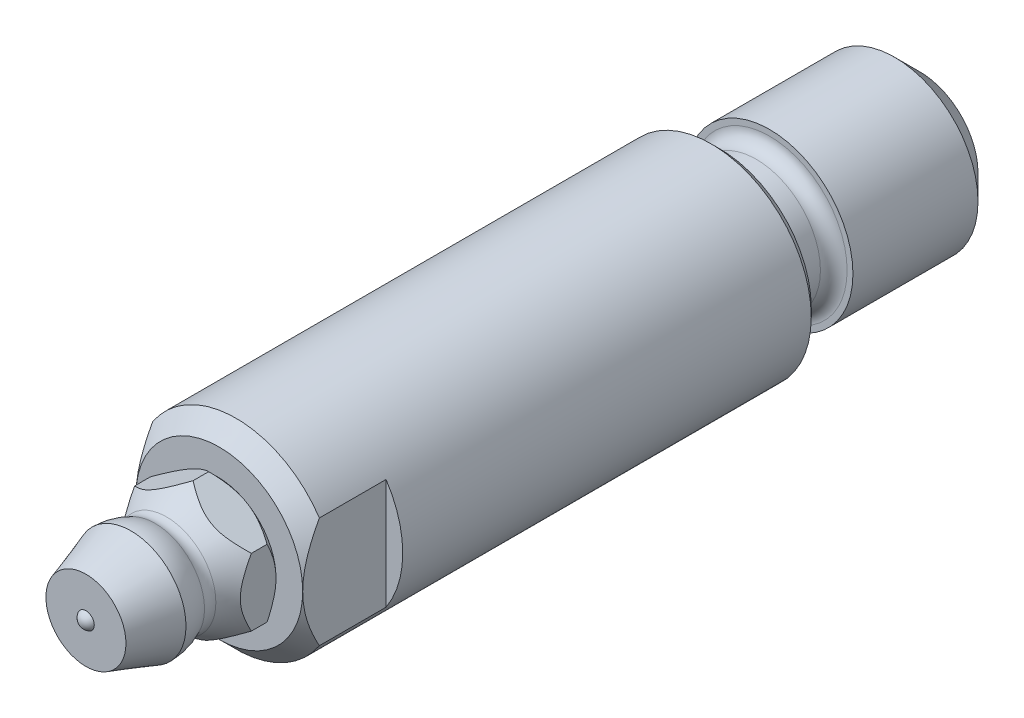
ISO-10303-21;
HEADER;
FILE_DESCRIPTION(('STEP AP214'),'2;1');
FILE_NAME('part.step','',(''),(''),'','','');
FILE_SCHEMA(('AUTOMOTIVE_DESIGN { 1 0 10303 214 1 1 1 1 }'));
ENDSEC;
DATA;
#1=APPLICATION_CONTEXT('core data for automotive mechanical design processes');
#2=APPLICATION_PROTOCOL_DEFINITION('international standard','automotive_design',2000,#1);
#3=PRODUCT_CONTEXT('',#1,'mechanical');
#4=PRODUCT('Part','Part','',(#3));
#5=PRODUCT_RELATED_PRODUCT_CATEGORY('part','',(#4));
#6=PRODUCT_DEFINITION_FORMATION('','',#4);
#7=PRODUCT_DEFINITION_CONTEXT('part definition',#1,'design');
#8=PRODUCT_DEFINITION('design','',#6,#7);
#9=PRODUCT_DEFINITION_SHAPE('','',#8);
#10=(LENGTH_UNIT() NAMED_UNIT(*) SI_UNIT(.MILLI.,.METRE.));
#11=(NAMED_UNIT(*) PLANE_ANGLE_UNIT() SI_UNIT($,.RADIAN.));
#12=(NAMED_UNIT(*) SI_UNIT($,.STERADIAN.) SOLID_ANGLE_UNIT());
#13=UNCERTAINTY_MEASURE_WITH_UNIT(LENGTH_MEASURE(1.E-05),#10,'distance_accuracy_value','');
#14=(GEOMETRIC_REPRESENTATION_CONTEXT(3) GLOBAL_UNCERTAINTY_ASSIGNED_CONTEXT((#13)) GLOBAL_UNIT_ASSIGNED_CONTEXT((#10,
#11,#12)) REPRESENTATION_CONTEXT('',''));
#15=CARTESIAN_POINT('',(0.,0.,0.));
#16=DIRECTION('',(0.,0.,1.));
#17=DIRECTION('',(1.,0.,0.));
#18=AXIS2_PLACEMENT_3D('',#15,#16,#17);
#19=CARTESIAN_POINT('',(0.,0.,28.9999999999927));
#20=DIRECTION('',(0.,0.,-1.));
#21=DIRECTION('',(-1.,0.,0.));
#22=AXIS2_PLACEMENT_3D('',#19,#20,#21);
#23=CONICAL_SURFACE('',#22,6.00000000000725,0.785398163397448);
#24=CARTESIAN_POINT('',(0.,0.,28.9999999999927));
#25=DIRECTION('',(0.,0.,1.));
#26=DIRECTION('',(1.,0.,0.));
#27=AXIS2_PLACEMENT_3D('',#24,#25,#26);
#28=CIRCLE('',#27,6.00000000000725);
#29=CARTESIAN_POINT('',(5.,3.31662479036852,28.9999999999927));
#30=VERTEX_POINT('',#29);
#31=CARTESIAN_POINT('',(-5.,3.31662479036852,28.9999999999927));
#32=VERTEX_POINT('',#31);
#33=EDGE_CURVE('E150',#30,#32,#28,.T.);
#34=ORIENTED_EDGE('',*,*,#33,.T.);
#35=CARTESIAN_POINT('',(-5.,-9.85255950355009,23.951338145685));
#36=CARTESIAN_POINT('',(-5.,-9.62580867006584,24.1535106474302));
#37=CARTESIAN_POINT('',(-5.,-9.39837368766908,24.3549228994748));
#38=CARTESIAN_POINT('',(-5.,-8.94177326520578,24.7558217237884));
#39=CARTESIAN_POINT('',(-5.,-8.71260765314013,24.9553081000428));
#40=CARTESIAN_POINT('',(-5.,-8.25128350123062,25.3527239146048));
#41=CARTESIAN_POINT('',(-5.,-8.0191165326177,25.550643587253));
#42=CARTESIAN_POINT('',(-5.,-7.55226186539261,25.943470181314));
#43=CARTESIAN_POINT('',(-5.,-7.31757428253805,26.1383772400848));
#44=CARTESIAN_POINT('',(-5.,-6.83094792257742,26.5359016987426));
#45=CARTESIAN_POINT('',(-5.,-6.57881630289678,26.738283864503));
#46=CARTESIAN_POINT('',(-5.,-6.07009815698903,27.1373545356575));
#47=CARTESIAN_POINT('',(-5.,-5.81351190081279,27.3340433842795));
#48=CARTESIAN_POINT('',(-5.,-5.29500073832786,27.7194167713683));
#49=CARTESIAN_POINT('',(-5.,-5.03308533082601,27.9081139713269));
#50=CARTESIAN_POINT('',(-5.,-4.6346588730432,28.1830436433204));
#51=CARTESIAN_POINT('',(-5.,-4.50094147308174,28.2733234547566));
#52=CARTESIAN_POINT('',(-5.,-4.23137292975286,28.4506336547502));
#53=CARTESIAN_POINT('',(-5.,-4.09552186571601,28.5376641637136));
#54=CARTESIAN_POINT('',(-5.,-3.76419991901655,28.7433269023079));
#55=CARTESIAN_POINT('',(-5.,-3.567499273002,28.8599967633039));
#56=CARTESIAN_POINT('',(-5.,-3.16821250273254,29.0830627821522));
#57=CARTESIAN_POINT('',(-5.,-2.96562447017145,29.1894555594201));
#58=CARTESIAN_POINT('',(-5.,-2.55552159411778,29.3876266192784));
#59=CARTESIAN_POINT('',(-5.,-2.34806519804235,29.4795243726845));
#60=CARTESIAN_POINT('',(-5.,-1.92607253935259,29.6453547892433));
#61=CARTESIAN_POINT('',(-5.,-1.71154124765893,29.7192997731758));
#62=CARTESIAN_POINT('',(-5.,-1.3479692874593,29.8233667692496));
#63=CARTESIAN_POINT('',(-5.,-1.20076442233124,29.8598920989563));
#64=CARTESIAN_POINT('',(-5.,-0.903884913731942,29.9210302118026));
#65=CARTESIAN_POINT('',(-5.,-0.754210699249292,29.9456450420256));
#66=CARTESIAN_POINT('',(-5.,-0.453809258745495,29.9816536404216));
#67=CARTESIAN_POINT('',(-5.,-0.303087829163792,29.9930950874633));
#68=CARTESIAN_POINT('',(-5.,-0.0012204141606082,30.002275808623));
#69=CARTESIAN_POINT('',(-5.,0.149925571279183,30.0000150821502));
#70=CARTESIAN_POINT('',(-5.,0.450667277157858,29.9819655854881));
#71=CARTESIAN_POINT('',(-5.,0.600266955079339,29.9662416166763));
#72=CARTESIAN_POINT('',(-5.,0.897608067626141,29.9221991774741));
#73=CARTESIAN_POINT('',(-5.,1.04534905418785,29.8938777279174));
#74=CARTESIAN_POINT('',(-5.,1.33985948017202,29.8255961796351));
#75=CARTESIAN_POINT('',(-5.,1.48659862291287,29.785507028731));
#76=CARTESIAN_POINT('',(-5.,1.77693747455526,29.6954308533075));
#77=CARTESIAN_POINT('',(-5.,1.92053775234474,29.645445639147));
#78=CARTESIAN_POINT('',(-5.,2.25046124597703,29.5196377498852));
#79=CARTESIAN_POINT('',(-5.,2.43558592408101,29.4406865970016));
#80=CARTESIAN_POINT('',(-5.,2.80058365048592,29.2713786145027));
#81=CARTESIAN_POINT('',(-5.,2.98045377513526,29.1810155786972));
#82=CARTESIAN_POINT('',(-5.,3.33608484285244,28.9911080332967));
#83=CARTESIAN_POINT('',(-5.,3.51182842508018,28.8915312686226));
#84=CARTESIAN_POINT('',(-5.,3.85913743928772,28.6854603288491));
#85=CARTESIAN_POINT('',(-5.,4.03070366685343,28.578967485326));
#86=CARTESIAN_POINT('',(-5.,4.36186106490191,28.3659530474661));
#87=CARTESIAN_POINT('',(-5.,4.52162345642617,28.2596962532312));
#88=CARTESIAN_POINT('',(-5.,4.83843549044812,28.0431980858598));
#89=CARTESIAN_POINT('',(-5.,4.9954849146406,27.9329563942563));
#90=CARTESIAN_POINT('',(-5.,5.30588295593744,27.7102271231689));
#91=CARTESIAN_POINT('',(-5.,5.45925199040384,27.5977678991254));
#92=CARTESIAN_POINT('',(-5.,5.76397812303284,27.3702364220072));
#93=CARTESIAN_POINT('',(-5.,5.91533574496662,27.255164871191));
#94=CARTESIAN_POINT('',(-5.,6.06586539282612,27.1390380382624));
#95=B_SPLINE_CURVE_WITH_KNOTS('',3,(#35,#36,#37,#38,#39,#40,#41,#42,#43,#44,#45,#46,#47,#48,#49,
#50,#51,#52,#53,#54,#55,#56,#57,#58,#59,#60,#61,#62,#63,#64,#65,#66,#67,#68,#69,#70,#71,#72,#73,
#74,#75,#76,#77,#78,#79,#80,#81,#82,#83,#84,#85,#86,#87,#88,#89,#90,#91,#92,#93,#94),
.UNSPECIFIED.,.F.,.F.,(4,2,2,2,2,2,2,2,2,2,2,2,2,2,2,2,2,2,2,2,2,2,2,2,2,2,2,2,2,4),(0.,
0.911381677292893,1.82285515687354,2.73807390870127,3.65325080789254,4.6231152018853,
5.59292100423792,6.56112796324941,7.04511106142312,7.52907620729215,8.21493318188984,
8.9010150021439,9.581107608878,10.2607321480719,10.715321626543,11.1698329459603,
11.6226940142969,12.0755551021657,12.5262486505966,12.9770488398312,13.4329902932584,
13.8888484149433,14.4920977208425,15.0956765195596,15.7014545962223,16.3071163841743,
16.8826582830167,17.4582462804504,18.0287616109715,18.5991253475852),.UNSPECIFIED.);
#96=CARTESIAN_POINT('',(-5.,0.,29.9999999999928));
#97=VERTEX_POINT('',#96);
#98=EDGE_CURVE('E137',#32,#97,#95,.F.);
#99=ORIENTED_EDGE('',*,*,#98,.T.);
#100=CARTESIAN_POINT('',(0.,0.,29.9999999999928));
#101=DIRECTION('',(0.,0.,1.));
#102=DIRECTION('',(1.,0.,0.));
#103=AXIS2_PLACEMENT_3D('',#100,#101,#102);
#104=CIRCLE('',#103,5.00000000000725);
#105=CARTESIAN_POINT('',(5.,0.,29.9999999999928));
#106=VERTEX_POINT('',#105);
#107=EDGE_CURVE('E148',#106,#97,#104,.T.);
#108=ORIENTED_EDGE('',*,*,#107,.F.);
#109=CARTESIAN_POINT('',(5.,-9.85255950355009,23.951338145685));
#110=CARTESIAN_POINT('',(5.,-9.62580867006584,24.1535106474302));
#111=CARTESIAN_POINT('',(5.,-9.39837368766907,24.3549228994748));
#112=CARTESIAN_POINT('',(5.,-8.94177326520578,24.7558217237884));
#113=CARTESIAN_POINT('',(5.,-8.71260765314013,24.9553081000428));
#114=CARTESIAN_POINT('',(5.,-8.25128350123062,25.3527239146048));
#115=CARTESIAN_POINT('',(5.,-8.0191165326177,25.550643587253));
#116=CARTESIAN_POINT('',(5.,-7.55226186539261,25.943470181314));
#117=CARTESIAN_POINT('',(5.,-7.31757428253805,26.1383772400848));
#118=CARTESIAN_POINT('',(5.,-6.83094792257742,26.5359016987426));
#119=CARTESIAN_POINT('',(5.,-6.57881630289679,26.738283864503));
#120=CARTESIAN_POINT('',(5.,-6.07009815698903,27.1373545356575));
#121=CARTESIAN_POINT('',(5.,-5.81351190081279,27.3340433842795));
#122=CARTESIAN_POINT('',(5.,-5.29500073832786,27.7194167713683));
#123=CARTESIAN_POINT('',(5.,-5.03308533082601,27.9081139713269));
#124=CARTESIAN_POINT('',(5.,-4.63465887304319,28.1830436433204));
#125=CARTESIAN_POINT('',(5.,-4.50094147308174,28.2733234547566));
#126=CARTESIAN_POINT('',(5.,-4.23137292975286,28.4506336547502));
#127=CARTESIAN_POINT('',(5.,-4.09552186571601,28.5376641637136));
#128=CARTESIAN_POINT('',(5.,-3.76419991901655,28.7433269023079));
#129=CARTESIAN_POINT('',(5.,-3.567499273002,28.8599967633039));
#130=CARTESIAN_POINT('',(5.,-3.16821250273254,29.0830627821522));
#131=CARTESIAN_POINT('',(5.,-2.96562447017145,29.1894555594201));
#132=CARTESIAN_POINT('',(5.,-2.55552159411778,29.3876266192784));
#133=CARTESIAN_POINT('',(5.,-2.34806519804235,29.4795243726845));
#134=CARTESIAN_POINT('',(5.,-1.9260725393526,29.6453547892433));
#135=CARTESIAN_POINT('',(5.,-1.71154124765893,29.7192997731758));
#136=CARTESIAN_POINT('',(5.,-1.34796928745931,29.8233667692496));
#137=CARTESIAN_POINT('',(5.,-1.20076442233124,29.8598920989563));
#138=CARTESIAN_POINT('',(5.,-0.903884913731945,29.9210302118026));
#139=CARTESIAN_POINT('',(5.,-0.754210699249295,29.9456450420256));
#140=CARTESIAN_POINT('',(5.,-0.453809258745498,29.9816536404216));
#141=CARTESIAN_POINT('',(5.,-0.303087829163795,29.9930950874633));
#142=CARTESIAN_POINT('',(5.,-0.00122041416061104,30.002275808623));
#143=CARTESIAN_POINT('',(5.,0.149925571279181,30.0000150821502));
#144=CARTESIAN_POINT('',(5.,0.450667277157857,29.9819655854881));
#145=CARTESIAN_POINT('',(5.,0.600266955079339,29.9662416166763));
#146=CARTESIAN_POINT('',(5.,0.897608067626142,29.922199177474));
#147=CARTESIAN_POINT('',(5.,1.04534905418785,29.8938777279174));
#148=CARTESIAN_POINT('',(5.,1.33985948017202,29.8255961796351));
#149=CARTESIAN_POINT('',(5.,1.48659862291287,29.785507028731));
#150=CARTESIAN_POINT('',(5.,1.77693747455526,29.6954308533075));
#151=CARTESIAN_POINT('',(5.,1.92053775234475,29.645445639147));
#152=CARTESIAN_POINT('',(5.,2.25046124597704,29.5196377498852));
#153=CARTESIAN_POINT('',(5.,2.43558592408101,29.4406865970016));
#154=CARTESIAN_POINT('',(5.,2.80058365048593,29.2713786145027));
#155=CARTESIAN_POINT('',(5.,2.98045377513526,29.1810155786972));
#156=CARTESIAN_POINT('',(5.,3.33608484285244,28.9911080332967));
#157=CARTESIAN_POINT('',(5.,3.51182842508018,28.8915312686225));
#158=CARTESIAN_POINT('',(5.,3.85913743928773,28.6854603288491));
#159=CARTESIAN_POINT('',(5.,4.03070366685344,28.578967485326));
#160=CARTESIAN_POINT('',(5.,4.36186106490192,28.3659530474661));
#161=CARTESIAN_POINT('',(5.,4.52162345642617,28.2596962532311));
#162=CARTESIAN_POINT('',(5.,4.83843549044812,28.0431980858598));
#163=CARTESIAN_POINT('',(5.,4.9954849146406,27.9329563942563));
#164=CARTESIAN_POINT('',(5.,5.30588295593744,27.7102271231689));
#165=CARTESIAN_POINT('',(5.,5.45925199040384,27.5977678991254));
#166=CARTESIAN_POINT('',(5.,5.76397812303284,27.3702364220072));
#167=CARTESIAN_POINT('',(5.,5.91533574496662,27.255164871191));
#168=CARTESIAN_POINT('',(5.,6.06586539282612,27.1390380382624));
#169=B_SPLINE_CURVE_WITH_KNOTS('',3,(#109,#110,#111,#112,#113,#114,#115,#116,#117,#118,#119,
#120,#121,#122,#123,#124,#125,#126,#127,#128,#129,#130,#131,#132,#133,#134,#135,#136,#137,#138,
#139,#140,#141,#142,#143,#144,#145,#146,#147,#148,#149,#150,#151,#152,#153,#154,#155,#156,#157,
#158,#159,#160,#161,#162,#163,#164,#165,#166,#167,#168),.UNSPECIFIED.,.F.,.F.,(4,2,2,2,2,2,2,2,
2,2,2,2,2,2,2,2,2,2,2,2,2,2,2,2,2,2,2,2,2,4),(0.,0.911381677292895,1.82285515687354,
2.73807390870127,3.65325080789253,4.6231152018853,5.59292100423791,6.56112796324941,
7.04511106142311,7.52907620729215,8.21493318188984,8.90101500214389,9.58110760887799,
10.2607321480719,10.715321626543,11.1698329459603,11.6226940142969,12.0755551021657,
12.5262486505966,12.9770488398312,13.4329902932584,13.8888484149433,14.4920977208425,
15.0956765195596,15.7014545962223,16.3071163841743,16.8826582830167,17.4582462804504,
18.0287616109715,18.5991253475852),.UNSPECIFIED.);
#170=EDGE_CURVE('E274',#106,#30,#169,.T.);
#171=ORIENTED_EDGE('',*,*,#170,.T.);
#172=EDGE_LOOP('',(#34,#99,#108,#171));
#173=FACE_BOUND('',#172,.T.);
#174=ADVANCED_FACE('F14',(#173),#23,.T.);
#175=CARTESIAN_POINT('',(0.,0.,31.1164468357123));
#176=DIRECTION('',(0.,0.,1.));
#177=DIRECTION('',(1.,0.,0.));
#178=AXIS2_PLACEMENT_3D('',#175,#176,#177);
#179=TOROIDAL_SURFACE('',#178,3.03108891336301,1.11644683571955);
#180=CARTESIAN_POINT('',(0.,0.,29.9999999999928));
#181=DIRECTION('',(0.,0.,1.));
#182=DIRECTION('',(1.,0.,0.));
#183=AXIS2_PLACEMENT_3D('',#180,#181,#182);
#184=CIRCLE('',#183,3.03108891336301);
#185=CARTESIAN_POINT('',(3.03108891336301,0.,29.9999999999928));
#186=VERTEX_POINT('',#185);
#187=EDGE_CURVE('E157',#186,#186,#184,.T.);
#188=ORIENTED_EDGE('',*,*,#187,.T.);
#189=EDGE_LOOP('',(#188));
#190=FACE_BOUND('',#189,.T.);
#191=CARTESIAN_POINT('',(1.92879611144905,2.92786093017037,30.1060838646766));
#192=DIRECTION('',(-0.866025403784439,0.5,0.));
#193=VECTOR('',#192,1.);
#194=LINE('',#191,#193);
#195=CARTESIAN_POINT('',(1.92879611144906,2.92786093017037,30.1060838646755));
#196=VERTEX_POINT('',#195);
#197=CARTESIAN_POINT('',(1.57120388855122,3.13431689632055,30.1060838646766));
#198=VERTEX_POINT('',#197);
#199=EDGE_CURVE('E257',#196,#198,#194,.T.);
#200=ORIENTED_EDGE('',*,*,#199,.F.);
#201=CARTESIAN_POINT('',(0.,0.,30.1060838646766));
#202=DIRECTION('',(0.,0.,1.));
#203=DIRECTION('',(1.,0.,0.));
#204=AXIS2_PLACEMENT_3D('',#201,#202,#203);
#205=CIRCLE('',#204,3.50608386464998);
#206=CARTESIAN_POINT('',(3.5,0.20645596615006,30.1060838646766));
#207=VERTEX_POINT('',#206);
#208=EDGE_CURVE('E246',#207,#196,#205,.T.);
#209=ORIENTED_EDGE('',*,*,#208,.F.);
#210=CARTESIAN_POINT('',(3.5,-0.20645596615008,30.1060838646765));
#211=DIRECTION('',(0.,1.,1.34438234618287E-13));
#212=VECTOR('',#211,1.);
#213=LINE('',#210,#212);
#214=CARTESIAN_POINT('',(3.5,-0.206455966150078,30.1060838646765));
#215=VERTEX_POINT('',#214);
#216=EDGE_CURVE('E243',#215,#207,#213,.T.);
#217=ORIENTED_EDGE('',*,*,#216,.F.);
#218=CARTESIAN_POINT('',(1.92879611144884,-2.92786093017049,30.1060838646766));
#219=VERTEX_POINT('',#218);
#220=EDGE_CURVE('E208',#219,#215,#205,.T.);
#221=ORIENTED_EDGE('',*,*,#220,.F.);
#222=CARTESIAN_POINT('',(1.57120388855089,-3.13431689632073,30.1060838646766));
#223=DIRECTION('',(0.866025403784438,0.500000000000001,0.));
#224=VECTOR('',#223,1.);
#225=LINE('',#222,#224);
#226=CARTESIAN_POINT('',(1.57120388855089,-3.13431689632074,30.1060838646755));
#227=VERTEX_POINT('',#226);
#228=EDGE_CURVE('E489',#227,#219,#225,.T.);
#229=ORIENTED_EDGE('',*,*,#228,.F.);
#230=CARTESIAN_POINT('',(-1.5712038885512,-3.13431689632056,30.1060838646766));
#231=VERTEX_POINT('',#230);
#232=EDGE_CURVE('E229',#231,#227,#205,.T.);
#233=ORIENTED_EDGE('',*,*,#232,.F.);
#234=CARTESIAN_POINT('',(-1.92879611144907,-2.92786093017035,30.1060838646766));
#235=DIRECTION('',(0.866025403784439,-0.499999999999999,0.));
#236=VECTOR('',#235,1.);
#237=LINE('',#234,#236);
#238=CARTESIAN_POINT('',(-1.92879611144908,-2.92786093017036,30.1060838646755));
#239=VERTEX_POINT('',#238);
#240=EDGE_CURVE('E502',#239,#231,#237,.T.);
#241=ORIENTED_EDGE('',*,*,#240,.F.);
#242=CARTESIAN_POINT('',(-3.5,-0.206455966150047,30.1060838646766));
#243=VERTEX_POINT('',#242);
#244=EDGE_CURVE('E225',#243,#239,#205,.T.);
#245=ORIENTED_EDGE('',*,*,#244,.F.);
#246=CARTESIAN_POINT('',(-3.5,0.20645596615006,30.1060838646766));
#247=DIRECTION('',(0.,-1.,-1.17633455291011E-13));
#248=VECTOR('',#247,1.);
#249=LINE('',#246,#248);
#250=CARTESIAN_POINT('',(-3.5,0.206455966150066,30.1060838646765));
#251=VERTEX_POINT('',#250);
#252=EDGE_CURVE('E356',#251,#243,#249,.T.);
#253=ORIENTED_EDGE('',*,*,#252,.F.);
#254=CARTESIAN_POINT('',(-1.92879611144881,2.92786093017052,30.1060838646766));
#255=VERTEX_POINT('',#254);
#256=EDGE_CURVE('E216',#255,#251,#205,.T.);
#257=ORIENTED_EDGE('',*,*,#256,.F.);
#258=CARTESIAN_POINT('',(-1.57120388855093,3.13431689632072,30.1060838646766));
#259=DIRECTION('',(-0.866025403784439,-0.5,0.));
#260=VECTOR('',#259,1.);
#261=LINE('',#258,#260);
#262=CARTESIAN_POINT('',(-1.57120388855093,3.13431689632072,30.1060838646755));
#263=VERTEX_POINT('',#262);
#264=EDGE_CURVE('E351',#263,#255,#261,.T.);
#265=ORIENTED_EDGE('',*,*,#264,.F.);
#266=EDGE_CURVE('E222',#198,#263,#205,.T.);
#267=ORIENTED_EDGE('',*,*,#266,.F.);
#268=EDGE_LOOP('',(#200,#209,#217,#221,#229,#233,#241,#245,#253,#257,#265,#267));
#269=FACE_BOUND('',#268,.T.);
#270=ADVANCED_FACE('F16',(#190,#269),#179,.T.);
#271=CARTESIAN_POINT('',(0.,0.,30.1060838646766));
#272=DIRECTION('',(0.,0.,1.));
#273=DIRECTION('',(1.,0.,0.));
#274=AXIS2_PLACEMENT_3D('',#271,#272,#273);
#275=CONICAL_SURFACE('',#274,3.50608386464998,0.785398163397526);
#276=CARTESIAN_POINT('',(5.94625453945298,0.608380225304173,32.5772961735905));
#277=CARTESIAN_POINT('',(5.8633560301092,0.656241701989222,32.4997086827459));
#278=CARTESIAN_POINT('',(5.78012919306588,0.704292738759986,32.4225847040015));
#279=CARTESIAN_POINT('',(5.61290524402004,0.800839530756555,32.2694410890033));
#280=CARTESIAN_POINT('',(5.52890806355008,0.849335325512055,32.193421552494));
#281=CARTESIAN_POINT('',(5.35984587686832,0.946943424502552,32.0425006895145));
#282=CARTESIAN_POINT('',(5.27477882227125,0.996056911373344,31.9676024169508));
#283=CARTESIAN_POINT('',(5.10364289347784,1.09486228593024,31.8193508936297));
#284=CARTESIAN_POINT('',(5.01757404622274,1.14455415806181,31.7459976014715));
#285=CARTESIAN_POINT('',(4.84189320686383,1.24598353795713,31.5991372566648));
#286=CARTESIAN_POINT('',(4.75224891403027,1.2977396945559,31.5256815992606));
#287=CARTESIAN_POINT('',(4.57154729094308,1.40206782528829,31.381127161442));
#288=CARTESIAN_POINT('',(4.48049001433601,1.45463976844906,31.3100282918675));
#289=CARTESIAN_POINT('',(4.29680977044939,1.56068760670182,31.1707685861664));
#290=CARTESIAN_POINT('',(4.20418819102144,1.61416270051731,31.1026053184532));
#291=CARTESIAN_POINT('',(4.01705902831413,1.72220177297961,30.9698370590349));
#292=CARTESIAN_POINT('',(3.92255168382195,1.77676561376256,30.9052316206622));
#293=CARTESIAN_POINT('',(3.72879115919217,1.88863330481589,30.7787645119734));
#294=CARTESIAN_POINT('',(3.62947868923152,1.94597138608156,30.7170231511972));
#295=CARTESIAN_POINT('',(3.4282398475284,2.06215668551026,30.5994096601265));
#296=CARTESIAN_POINT('',(3.32631310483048,2.12100411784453,30.5435383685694));
#297=CARTESIAN_POINT('',(3.12017661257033,2.24001707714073,30.4395031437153));
#298=CARTESIAN_POINT('',(3.01598213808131,2.30017378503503,30.3912992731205));
#299=CARTESIAN_POINT('',(2.80472828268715,2.4221412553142,30.3040945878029));
#300=CARTESIAN_POINT('',(2.69766978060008,2.48395151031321,30.2650909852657));
#301=CARTESIAN_POINT('',(2.50221323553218,2.59679839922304,30.2048637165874));
#302=CARTESIAN_POINT('',(2.41427702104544,2.64756839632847,30.1816528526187));
#303=CARTESIAN_POINT('',(2.23706418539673,2.74988227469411,30.1434751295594));
#304=CARTESIAN_POINT('',(2.14778776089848,2.80142604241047,30.1285070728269));
#305=CARTESIAN_POINT('',(1.96859557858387,2.90488269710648,30.1075835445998));
#306=CARTESIAN_POINT('',(1.87868124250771,2.95679476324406,30.1016120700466));
#307=CARTESIAN_POINT('',(1.69874701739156,3.06067983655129,30.0989588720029));
#308=CARTESIAN_POINT('',(1.60872712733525,3.11265284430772,30.1022772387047));
#309=CARTESIAN_POINT('',(1.42952917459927,3.21611283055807,30.1179988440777));
#310=CARTESIAN_POINT('',(1.34034953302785,3.26760072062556,30.1303784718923));
#311=CARTESIAN_POINT('',(1.16316898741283,3.36989595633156,30.1635602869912));
#312=CARTESIAN_POINT('',(1.07516836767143,3.42070313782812,30.1843644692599));
#313=CARTESIAN_POINT('',(0.900509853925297,3.5215422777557,30.233535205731));
#314=CARTESIAN_POINT('',(0.813856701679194,3.57157149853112,30.2619239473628));
#315=CARTESIAN_POINT('',(0.642369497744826,3.6705796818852,30.3251829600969));
#316=CARTESIAN_POINT('',(0.557535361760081,3.71955869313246,30.3600529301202));
#317=CARTESIAN_POINT('',(0.360078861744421,3.83356025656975,30.4485356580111));
#318=CARTESIAN_POINT('',(0.248222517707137,3.89814054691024,30.5044187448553));
#319=CARTESIAN_POINT('',(0.027666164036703,4.02547881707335,30.6240021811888));
#320=CARTESIAN_POINT('',(-0.0810321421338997,4.0882358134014,30.6877066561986));
#321=CARTESIAN_POINT('',(-0.295802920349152,4.21223378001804,30.8213125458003));
#322=CARTESIAN_POINT('',(-0.401869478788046,4.27347133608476,30.8912265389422));
#323=CARTESIAN_POINT('',(-0.611511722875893,4.39450834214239,31.0357897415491));
#324=CARTESIAN_POINT('',(-0.715087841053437,4.45430804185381,31.1104381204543));
#325=CARTESIAN_POINT('',(-0.920611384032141,4.57296711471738,31.2638307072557));
#326=CARTESIAN_POINT('',(-1.02254903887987,4.63182084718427,31.3425922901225));
#327=CARTESIAN_POINT('',(-1.22462881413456,4.74849165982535,31.5031358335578));
#328=CARTESIAN_POINT('',(-1.32477078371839,4.80630865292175,31.5849180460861));
#329=CARTESIAN_POINT('',(-1.62270663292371,4.97832199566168,31.8337034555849));
#330=CARTESIAN_POINT('',(-1.81823902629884,5.0912126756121,32.0043198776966));
#331=CARTESIAN_POINT('',(-2.08475883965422,5.24508796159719,32.2439714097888));
#332=CARTESIAN_POINT('',(-2.15763750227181,5.28716447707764,32.3102490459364));
#333=CARTESIAN_POINT('',(-2.3025097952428,5.37080653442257,32.4433330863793));
#334=CARTESIAN_POINT('',(-2.37450590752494,5.41237350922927,32.5101358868));
#335=CARTESIAN_POINT('',(-2.44625453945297,5.45379760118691,32.5772961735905));
#336=B_SPLINE_CURVE_WITH_KNOTS('',3,(#276,#277,#278,#279,#280,#281,#282,#283,#284,#285,#286,
#287,#288,#289,#290,#291,#292,#293,#294,#295,#296,#297,#298,#299,#300,#301,#302,#303,#304,#305,
#306,#307,#308,#309,#310,#311,#312,#313,#314,#315,#316,#317,#318,#319,#320,#321,#322,#323,#324,
#325,#326,#327,#328,#329,#330,#331,#332,#333,#334,#335),.UNSPECIFIED.,.F.,.F.,(4,2,2,2,2,2,2,2,
2,2,2,2,2,2,2,2,2,2,2,2,2,2,2,2,2,2,2,2,2,4),(0.,0.369656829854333,0.739346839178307,
1.10990719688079,1.48045761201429,1.86121249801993,2.24195296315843,2.62237174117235,
3.00274265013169,3.39333042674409,3.78397393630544,4.17251089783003,4.56092997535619,
4.87311040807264,5.18524547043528,5.49682465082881,5.80840685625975,6.11918005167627,
6.43002688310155,6.74179319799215,7.05354503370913,7.47538572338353,7.89744988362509,
8.32038941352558,8.74325495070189,9.16807978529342,9.59294013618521,10.4417125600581,
10.7630683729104,11.0830119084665),.UNSPECIFIED.);
#337=CARTESIAN_POINT('',(3.5,2.02072594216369,30.6414518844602));
#338=VERTEX_POINT('',#337);
#339=EDGE_CURVE('E463',#338,#196,#336,.T.);
#340=ORIENTED_EDGE('',*,*,#339,.F.);
#341=CARTESIAN_POINT('',(3.5,-4.46698048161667,32.2748493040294));
#342=CARTESIAN_POINT('',(3.5,-4.3669664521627,32.196136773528));
#343=CARTESIAN_POINT('',(3.5,-4.26647296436,32.1180256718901));
#344=CARTESIAN_POINT('',(3.5,-4.06434202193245,31.9632646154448));
#345=CARTESIAN_POINT('',(3.5,-3.96270438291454,31.8866149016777));
#346=CARTESIAN_POINT('',(3.5,-3.75761872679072,31.7346800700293));
#347=CARTESIAN_POINT('',(3.5,-3.65416417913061,31.6594037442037));
#348=CARTESIAN_POINT('',(3.5,-3.44574000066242,31.5109843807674));
#349=CARTESIAN_POINT('',(3.5,-3.34077044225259,31.4378412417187));
#350=CARTESIAN_POINT('',(3.5,-3.12383791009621,31.2905975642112));
#351=CARTESIAN_POINT('',(3.5,-3.01178558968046,31.2166281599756));
#352=CARTESIAN_POINT('',(3.5,-2.78541737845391,31.0722420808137));
#353=CARTESIAN_POINT('',(3.5,-2.67110167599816,31.0018251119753));
#354=CARTESIAN_POINT('',(3.5,-2.44004529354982,30.8655749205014));
#355=CARTESIAN_POINT('',(3.5,-2.32330958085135,30.7997333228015));
#356=CARTESIAN_POINT('',(3.5,-2.08684689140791,30.6736867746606));
#357=CARTESIAN_POINT('',(3.5,-1.96712073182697,30.6134803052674));
#358=CARTESIAN_POINT('',(3.5,-1.73683478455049,30.5060627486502));
#359=CARTESIAN_POINT('',(3.5,-1.62660388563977,30.4581517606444));
#360=CARTESIAN_POINT('',(3.5,-1.40327226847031,30.3694395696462));
#361=CARTESIAN_POINT('',(3.5,-1.29017127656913,30.3286390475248));
#362=CARTESIAN_POINT('',(3.5,-1.06246216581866,30.2561346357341));
#363=CARTESIAN_POINT('',(3.5,-0.947885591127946,30.2243330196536));
#364=CARTESIAN_POINT('',(3.5,-0.716413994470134,30.1707967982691));
#365=CARTESIAN_POINT('',(3.5,-0.599519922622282,30.1490581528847));
#366=CARTESIAN_POINT('',(3.5,-0.361933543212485,30.1166611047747));
#367=CARTESIAN_POINT('',(3.5,-0.241211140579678,30.1062186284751));
#368=CARTESIAN_POINT('',(3.5,0.000663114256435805,30.0979132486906));
#369=CARTESIAN_POINT('',(3.5,0.121814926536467,30.1000492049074));
#370=CARTESIAN_POINT('',(3.5,0.36360342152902,30.1167613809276));
#371=CARTESIAN_POINT('',(3.5,0.484237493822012,30.1313746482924));
#372=CARTESIAN_POINT('',(3.5,0.72354670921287,30.1720571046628));
#373=CARTESIAN_POINT('',(3.5,0.842221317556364,30.1981293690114));
#374=CARTESIAN_POINT('',(3.5,1.11282163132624,30.2696756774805));
#375=CARTESIAN_POINT('',(3.5,1.26381559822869,30.3186448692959));
#376=CARTESIAN_POINT('',(3.5,1.56083811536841,30.4297767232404));
#377=CARTESIAN_POINT('',(3.5,1.70686364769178,30.4919472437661));
#378=CARTESIAN_POINT('',(3.5,1.9952507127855,30.6267426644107));
#379=CARTESIAN_POINT('',(3.5,2.13757744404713,30.6994410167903));
#380=CARTESIAN_POINT('',(3.5,2.41801104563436,30.8524082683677));
#381=CARTESIAN_POINT('',(3.5,2.55611888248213,30.9326754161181));
#382=CARTESIAN_POINT('',(3.5,2.84913144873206,31.111332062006));
#383=CARTESIAN_POINT('',(3.5,3.00347260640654,31.2106397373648));
#384=CARTESIAN_POINT('',(3.5,3.30842230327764,31.41485851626));
#385=CARTESIAN_POINT('',(3.5,3.45902998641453,31.5197708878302));
#386=CARTESIAN_POINT('',(3.5,3.75386895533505,31.7313935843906));
#387=CARTESIAN_POINT('',(3.5,3.8981674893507,31.8380107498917));
#388=CARTESIAN_POINT('',(3.5,4.18427999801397,32.0543209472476));
#389=CARTESIAN_POINT('',(3.5,4.32609570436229,32.164011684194));
#390=CARTESIAN_POINT('',(3.5,4.46698048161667,32.2748493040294));
#391=B_SPLINE_CURVE_WITH_KNOTS('',3,(#341,#342,#343,#344,#345,#346,#347,#348,#349,#350,#351,
#352,#353,#354,#355,#356,#357,#358,#359,#360,#361,#362,#363,#364,#365,#366,#367,#368,#369,#370,
#371,#372,#373,#374,#375,#376,#377,#378,#379,#380,#381,#382,#383,#384,#385,#386,#387,#388,#389,
#390),.UNSPECIFIED.,.F.,.F.,(4,2,2,2,2,2,2,2,2,2,2,2,2,2,2,2,2,2,2,2,2,2,2,2,4),(0.,
0.38182444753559,0.763711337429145,1.14751712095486,1.53130462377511,1.93404719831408,
2.33675639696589,2.73870789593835,3.14055073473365,3.50092995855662,3.86134367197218,
4.21767834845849,4.57386983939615,4.93675577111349,5.29960880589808,5.66354298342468,
6.02757489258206,6.50294839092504,6.97860566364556,7.45775758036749,7.93679889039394,
8.48722082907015,9.0377678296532,9.57596187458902,10.1137642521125),.UNSPECIFIED.);
#392=EDGE_CURVE('E455',#207,#338,#391,.T.);
#393=ORIENTED_EDGE('',*,*,#392,.F.);
#394=ORIENTED_EDGE('',*,*,#208,.T.);
#395=EDGE_LOOP('',(#340,#393,#394));
#396=FACE_BOUND('',#395,.T.);
#397=ADVANCED_FACE('F387',(#396),#275,.T.);
#398=CARTESIAN_POINT('',(3.5,-2.02072594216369,30.6414518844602));
#399=VERTEX_POINT('',#398);
#400=EDGE_CURVE('E449',#399,#215,#391,.T.);
#401=ORIENTED_EDGE('',*,*,#400,.F.);
#402=CARTESIAN_POINT('',(-2.44625453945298,-5.4537976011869,32.5772961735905));
#403=CARTESIAN_POINT('',(-2.3633560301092,-5.40593612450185,32.4997086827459));
#404=CARTESIAN_POINT('',(-2.28012919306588,-5.35788508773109,32.4225847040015));
#405=CARTESIAN_POINT('',(-2.11290524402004,-5.26133829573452,32.2694410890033));
#406=CARTESIAN_POINT('',(-2.02890806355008,-5.21284250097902,32.193421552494));
#407=CARTESIAN_POINT('',(-1.85984587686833,-5.11523440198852,32.0425006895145));
#408=CARTESIAN_POINT('',(-1.77477882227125,-5.06612091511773,31.9676024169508));
#409=CARTESIAN_POINT('',(-1.60364289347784,-4.96731554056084,31.8193508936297));
#410=CARTESIAN_POINT('',(-1.51757404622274,-4.91762366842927,31.7459976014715));
#411=CARTESIAN_POINT('',(-1.34189320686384,-4.81619428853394,31.5991372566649));
#412=CARTESIAN_POINT('',(-1.25224891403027,-4.76443813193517,31.5256815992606));
#413=CARTESIAN_POINT('',(-1.07154729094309,-4.66011000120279,31.381127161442));
#414=CARTESIAN_POINT('',(-0.980490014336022,-4.60753805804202,31.3100282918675));
#415=CARTESIAN_POINT('',(-0.796809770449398,-4.50149021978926,31.1707685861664));
#416=CARTESIAN_POINT('',(-0.704188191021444,-4.44801512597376,31.1026053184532));
#417=CARTESIAN_POINT('',(-0.517059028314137,-4.33997605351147,30.9698370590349));
#418=CARTESIAN_POINT('',(-0.422551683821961,-4.28541221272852,30.9052316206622));
#419=CARTESIAN_POINT('',(-0.228791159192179,-4.17354452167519,30.7787645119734));
#420=CARTESIAN_POINT('',(-0.12947868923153,-4.11620644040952,30.7170231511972));
#421=CARTESIAN_POINT('',(0.0717601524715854,-4.00002114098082,30.5994096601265));
#422=CARTESIAN_POINT('',(0.173686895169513,-3.94117370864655,30.5435383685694));
#423=CARTESIAN_POINT('',(0.379823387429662,-3.82216074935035,30.4395031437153));
#424=CARTESIAN_POINT('',(0.484017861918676,-3.76200404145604,30.3912992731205));
#425=CARTESIAN_POINT('',(0.695271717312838,-3.64003657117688,30.3040945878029));
#426=CARTESIAN_POINT('',(0.802330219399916,-3.57822631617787,30.2650909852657));
#427=CARTESIAN_POINT('',(0.997786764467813,-3.46537942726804,30.2048637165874));
#428=CARTESIAN_POINT('',(1.08572297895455,-3.4146094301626,30.1816528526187));
#429=CARTESIAN_POINT('',(1.26293581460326,-3.31229555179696,30.1434751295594));
#430=CARTESIAN_POINT('',(1.35221223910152,-3.26075178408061,30.1285070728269));
#431=CARTESIAN_POINT('',(1.53140442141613,-3.15729512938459,30.1075835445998));
#432=CARTESIAN_POINT('',(1.62131875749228,-3.10538306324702,30.1016120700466));
#433=CARTESIAN_POINT('',(1.80125298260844,-3.00149798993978,30.0989588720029));
#434=CARTESIAN_POINT('',(1.89127287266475,-2.94952498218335,30.1022772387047));
#435=CARTESIAN_POINT('',(2.07047082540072,-2.84606499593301,30.1179988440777));
#436=CARTESIAN_POINT('',(2.15965046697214,-2.79457710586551,30.1303784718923));
#437=CARTESIAN_POINT('',(2.33683101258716,-2.69228187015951,30.1635602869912));
#438=CARTESIAN_POINT('',(2.42483163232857,-2.64147468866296,30.1843644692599));
#439=CARTESIAN_POINT('',(2.5994901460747,-2.54063554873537,30.233535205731));
#440=CARTESIAN_POINT('',(2.6861432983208,-2.49060632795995,30.2619239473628));
#441=CARTESIAN_POINT('',(2.85763050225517,-2.39159814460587,30.3251829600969));
#442=CARTESIAN_POINT('',(2.94246463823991,-2.34261913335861,30.3600529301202));
#443=CARTESIAN_POINT('',(3.13992113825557,-2.22861756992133,30.4485356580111));
#444=CARTESIAN_POINT('',(3.25177748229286,-2.16403727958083,30.5044187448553));
#445=CARTESIAN_POINT('',(3.47233383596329,-2.03669900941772,30.6240021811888));
#446=CARTESIAN_POINT('',(3.5810321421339,-1.97394201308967,30.6877066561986));
#447=CARTESIAN_POINT('',(3.79580292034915,-1.84994404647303,30.8213125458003));
#448=CARTESIAN_POINT('',(3.90186947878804,-1.78870649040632,30.8912265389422));
#449=CARTESIAN_POINT('',(4.11151172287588,-1.66766948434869,31.0357897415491));
#450=CARTESIAN_POINT('',(4.21508784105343,-1.60786978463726,31.1104381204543));
#451=CARTESIAN_POINT('',(4.42061138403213,-1.4892107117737,31.2638307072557));
#452=CARTESIAN_POINT('',(4.52254903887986,-1.43035697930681,31.3425922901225));
#453=CARTESIAN_POINT('',(4.72462881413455,-1.31368616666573,31.5031358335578));
#454=CARTESIAN_POINT('',(4.82477078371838,-1.25586917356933,31.5849180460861));
#455=CARTESIAN_POINT('',(5.12270663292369,-1.08385583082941,31.8337034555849));
#456=CARTESIAN_POINT('',(5.31823902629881,-0.970965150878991,32.0043198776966));
#457=CARTESIAN_POINT('',(5.58475883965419,-0.817089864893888,32.2439714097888));
#458=CARTESIAN_POINT('',(5.65763750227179,-0.775013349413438,32.3102490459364));
#459=CARTESIAN_POINT('',(5.8025097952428,-0.691371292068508,32.4433330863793));
#460=CARTESIAN_POINT('',(5.87450590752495,-0.649804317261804,32.5101358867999));
#461=CARTESIAN_POINT('',(5.94625453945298,-0.608380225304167,32.5772961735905));
#462=B_SPLINE_CURVE_WITH_KNOTS('',3,(#402,#403,#404,#405,#406,#407,#408,#409,#410,#411,#412,
#413,#414,#415,#416,#417,#418,#419,#420,#421,#422,#423,#424,#425,#426,#427,#428,#429,#430,#431,
#432,#433,#434,#435,#436,#437,#438,#439,#440,#441,#442,#443,#444,#445,#446,#447,#448,#449,#450,
#451,#452,#453,#454,#455,#456,#457,#458,#459,#460,#461),.UNSPECIFIED.,.F.,.F.,(4,2,2,2,2,2,2,2,
2,2,2,2,2,2,2,2,2,2,2,2,2,2,2,2,2,2,2,2,2,4),(0.,0.369656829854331,0.739346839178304,
1.1099071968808,1.48045761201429,1.86121249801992,2.24195296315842,2.62237174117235,
3.00274265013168,3.39333042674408,3.78397393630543,4.17251089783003,4.56092997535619,
4.87311040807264,5.18524547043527,5.49682465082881,5.80840685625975,6.11918005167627,
6.43002688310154,6.74179319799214,7.05354503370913,7.47538572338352,7.89744988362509,
8.32038941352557,8.74325495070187,9.16807978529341,9.5929401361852,10.441712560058,
10.7630683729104,11.0830119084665),.UNSPECIFIED.);
#463=EDGE_CURVE('E495',#219,#399,#462,.T.);
#464=ORIENTED_EDGE('',*,*,#463,.F.);
#465=ORIENTED_EDGE('',*,*,#220,.T.);
#466=EDGE_LOOP('',(#401,#464,#465));
#467=FACE_BOUND('',#466,.T.);
#468=ADVANCED_FACE('F390',(#467),#275,.T.);
#469=CARTESIAN_POINT('',(0.,-4.04145188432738,30.6414518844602));
#470=VERTEX_POINT('',#469);
#471=EDGE_CURVE('E488',#470,#227,#462,.T.);
#472=ORIENTED_EDGE('',*,*,#471,.F.);
#473=CARTESIAN_POINT('',(-5.94625453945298,-0.608380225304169,32.5772961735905));
#474=CARTESIAN_POINT('',(-5.8633560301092,-0.656241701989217,32.4997086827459));
#475=CARTESIAN_POINT('',(-5.78012919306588,-0.704292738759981,32.4225847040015));
#476=CARTESIAN_POINT('',(-5.61290524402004,-0.80083953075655,32.2694410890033));
#477=CARTESIAN_POINT('',(-5.52890806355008,-0.849335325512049,32.193421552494));
#478=CARTESIAN_POINT('',(-5.35984587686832,-0.946943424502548,32.0425006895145));
#479=CARTESIAN_POINT('',(-5.27477882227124,-0.996056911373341,31.9676024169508));
#480=CARTESIAN_POINT('',(-5.10364289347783,-1.09486228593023,31.8193508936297));
#481=CARTESIAN_POINT('',(-5.01757404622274,-1.1445541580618,31.7459976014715));
#482=CARTESIAN_POINT('',(-4.84189320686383,-1.24598353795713,31.5991372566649));
#483=CARTESIAN_POINT('',(-4.75224891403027,-1.2977396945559,31.5256815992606));
#484=CARTESIAN_POINT('',(-4.57154729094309,-1.40206782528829,31.381127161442));
#485=CARTESIAN_POINT('',(-4.48049001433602,-1.45463976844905,31.3100282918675));
#486=CARTESIAN_POINT('',(-4.29680977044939,-1.56068760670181,31.1707685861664));
#487=CARTESIAN_POINT('',(-4.20418819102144,-1.61416270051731,31.1026053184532));
#488=CARTESIAN_POINT('',(-4.01705902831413,-1.7222017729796,30.9698370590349));
#489=CARTESIAN_POINT('',(-3.92255168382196,-1.77676561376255,30.9052316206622));
#490=CARTESIAN_POINT('',(-3.72879115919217,-1.88863330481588,30.7787645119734));
#491=CARTESIAN_POINT('',(-3.62947868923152,-1.94597138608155,30.7170231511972));
#492=CARTESIAN_POINT('',(-3.42823984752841,-2.06215668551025,30.5994096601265));
#493=CARTESIAN_POINT('',(-3.32631310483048,-2.12100411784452,30.5435383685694));
#494=CARTESIAN_POINT('',(-3.12017661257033,-2.24001707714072,30.4395031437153));
#495=CARTESIAN_POINT('',(-3.01598213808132,-2.30017378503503,30.3912992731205));
#496=CARTESIAN_POINT('',(-2.80472828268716,-2.42214125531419,30.3040945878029));
#497=CARTESIAN_POINT('',(-2.69766978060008,-2.48395151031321,30.2650909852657));
#498=CARTESIAN_POINT('',(-2.50221323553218,-2.59679839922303,30.2048637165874));
#499=CARTESIAN_POINT('',(-2.41427702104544,-2.64756839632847,30.1816528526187));
#500=CARTESIAN_POINT('',(-2.23706418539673,-2.74988227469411,30.1434751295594));
#501=CARTESIAN_POINT('',(-2.14778776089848,-2.80142604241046,30.1285070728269));
#502=CARTESIAN_POINT('',(-1.96859557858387,-2.90488269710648,30.1075835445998));
#503=CARTESIAN_POINT('',(-1.87868124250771,-2.95679476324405,30.1016120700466));
#504=CARTESIAN_POINT('',(-1.69874701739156,-3.06067983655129,30.0989588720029));
#505=CARTESIAN_POINT('',(-1.60872712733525,-3.11265284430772,30.1022772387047));
#506=CARTESIAN_POINT('',(-1.42952917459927,-3.21611283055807,30.1179988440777));
#507=CARTESIAN_POINT('',(-1.34034953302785,-3.26760072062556,30.1303784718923));
#508=CARTESIAN_POINT('',(-1.16316898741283,-3.36989595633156,30.1635602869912));
#509=CARTESIAN_POINT('',(-1.07516836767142,-3.42070313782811,30.1843644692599));
#510=CARTESIAN_POINT('',(-0.900509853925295,-3.5215422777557,30.233535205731));
#511=CARTESIAN_POINT('',(-0.813856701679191,-3.57157149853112,30.2619239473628));
#512=CARTESIAN_POINT('',(-0.642369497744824,-3.6705796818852,30.3251829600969));
#513=CARTESIAN_POINT('',(-0.557535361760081,-3.71955869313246,30.3600529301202));
#514=CARTESIAN_POINT('',(-0.360078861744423,-3.83356025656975,30.4485356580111));
#515=CARTESIAN_POINT('',(-0.248222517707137,-3.89814054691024,30.5044187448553));
#516=CARTESIAN_POINT('',(-0.0276661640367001,-4.02547881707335,30.6240021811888));
#517=CARTESIAN_POINT('',(0.0810321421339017,-4.0882358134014,30.6877066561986));
#518=CARTESIAN_POINT('',(0.295802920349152,-4.21223378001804,30.8213125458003));
#519=CARTESIAN_POINT('',(0.401869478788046,-4.27347133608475,30.8912265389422));
#520=CARTESIAN_POINT('',(0.611511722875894,-4.39450834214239,31.0357897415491));
#521=CARTESIAN_POINT('',(0.715087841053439,-4.45430804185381,31.1104381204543));
#522=CARTESIAN_POINT('',(0.920611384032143,-4.57296711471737,31.2638307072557));
#523=CARTESIAN_POINT('',(1.02254903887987,-4.63182084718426,31.3425922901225));
#524=CARTESIAN_POINT('',(1.22462881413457,-4.74849165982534,31.5031358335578));
#525=CARTESIAN_POINT('',(1.32477078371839,-4.80630865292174,31.5849180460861));
#526=CARTESIAN_POINT('',(1.62270663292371,-4.97832199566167,31.8337034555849));
#527=CARTESIAN_POINT('',(1.81823902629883,-5.0912126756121,32.0043198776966));
#528=CARTESIAN_POINT('',(2.08475883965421,-5.24508796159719,32.2439714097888));
#529=CARTESIAN_POINT('',(2.15763750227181,-5.28716447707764,32.3102490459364));
#530=CARTESIAN_POINT('',(2.30250979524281,-5.37080653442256,32.4433330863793));
#531=CARTESIAN_POINT('',(2.37450590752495,-5.41237350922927,32.5101358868));
#532=CARTESIAN_POINT('',(2.44625453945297,-5.45379760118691,32.5772961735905));
#533=B_SPLINE_CURVE_WITH_KNOTS('',3,(#473,#474,#475,#476,#477,#478,#479,#480,#481,#482,#483,
#484,#485,#486,#487,#488,#489,#490,#491,#492,#493,#494,#495,#496,#497,#498,#499,#500,#501,#502,
#503,#504,#505,#506,#507,#508,#509,#510,#511,#512,#513,#514,#515,#516,#517,#518,#519,#520,#521,
#522,#523,#524,#525,#526,#527,#528,#529,#530,#531,#532),.UNSPECIFIED.,.F.,.F.,(4,2,2,2,2,2,2,2,
2,2,2,2,2,2,2,2,2,2,2,2,2,2,2,2,2,2,2,2,2,4),(0.,0.369656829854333,0.739346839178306,
1.1099071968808,1.48045761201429,1.86121249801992,2.24195296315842,2.62237174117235,
3.00274265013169,3.39333042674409,3.78397393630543,4.17251089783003,4.56092997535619,
4.87311040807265,5.18524547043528,5.49682465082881,5.80840685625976,6.11918005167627,
6.43002688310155,6.74179319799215,7.05354503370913,7.47538572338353,7.89744988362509,
8.32038941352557,8.74325495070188,9.16807978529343,9.59294013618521,10.4417125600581,
10.7630683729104,11.0830119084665),.UNSPECIFIED.);
#534=EDGE_CURVE('E512',#231,#470,#533,.T.);
#535=ORIENTED_EDGE('',*,*,#534,.F.);
#536=ORIENTED_EDGE('',*,*,#232,.T.);
#537=EDGE_LOOP('',(#472,#535,#536));
#538=FACE_BOUND('',#537,.T.);
#539=ADVANCED_FACE('F785',(#538),#275,.T.);
#540=CARTESIAN_POINT('',(-3.5,-2.02072594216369,30.6414518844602));
#541=VERTEX_POINT('',#540);
#542=EDGE_CURVE('E501',#541,#239,#533,.T.);
#543=ORIENTED_EDGE('',*,*,#542,.F.);
#544=CARTESIAN_POINT('',(-3.5,4.46698048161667,32.2748493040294));
#545=CARTESIAN_POINT('',(-3.5,4.36696645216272,32.196136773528));
#546=CARTESIAN_POINT('',(-3.5,4.26647296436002,32.1180256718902));
#547=CARTESIAN_POINT('',(-3.5,4.06434202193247,31.9632646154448));
#548=CARTESIAN_POINT('',(-3.5,3.96270438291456,31.8866149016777));
#549=CARTESIAN_POINT('',(-3.5,3.75761872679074,31.7346800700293));
#550=CARTESIAN_POINT('',(-3.5,3.65416417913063,31.6594037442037));
#551=CARTESIAN_POINT('',(-3.5,3.44574000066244,31.5109843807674));
#552=CARTESIAN_POINT('',(-3.5,3.34077044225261,31.4378412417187));
#553=CARTESIAN_POINT('',(-3.5,3.12383791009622,31.2905975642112));
#554=CARTESIAN_POINT('',(-3.5,3.01178558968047,31.2166281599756));
#555=CARTESIAN_POINT('',(-3.5,2.78541737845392,31.0722420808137));
#556=CARTESIAN_POINT('',(-3.5,2.67110167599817,31.0018251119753));
#557=CARTESIAN_POINT('',(-3.5,2.44004529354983,30.8655749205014));
#558=CARTESIAN_POINT('',(-3.5,2.32330958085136,30.7997333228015));
#559=CARTESIAN_POINT('',(-3.5,2.08684689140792,30.6736867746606));
#560=CARTESIAN_POINT('',(-3.5,1.96712073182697,30.6134803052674));
#561=CARTESIAN_POINT('',(-3.5,1.73683478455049,30.5060627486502));
#562=CARTESIAN_POINT('',(-3.5,1.62660388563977,30.4581517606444));
#563=CARTESIAN_POINT('',(-3.5,1.40327226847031,30.3694395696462));
#564=CARTESIAN_POINT('',(-3.5,1.29017127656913,30.3286390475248));
#565=CARTESIAN_POINT('',(-3.5,1.06246216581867,30.2561346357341));
#566=CARTESIAN_POINT('',(-3.5,0.947885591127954,30.2243330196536));
#567=CARTESIAN_POINT('',(-3.5,0.716413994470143,30.1707967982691));
#568=CARTESIAN_POINT('',(-3.5,0.599519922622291,30.1490581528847));
#569=CARTESIAN_POINT('',(-3.5,0.361933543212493,30.1166611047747));
#570=CARTESIAN_POINT('',(-3.5,0.241211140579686,30.1062186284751));
#571=CARTESIAN_POINT('',(-3.5,-0.000663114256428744,30.0979132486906));
#572=CARTESIAN_POINT('',(-3.5,-0.121814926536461,30.1000492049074));
#573=CARTESIAN_POINT('',(-3.5,-0.363603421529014,30.1167613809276));
#574=CARTESIAN_POINT('',(-3.5,-0.484237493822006,30.1313746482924));
#575=CARTESIAN_POINT('',(-3.5,-0.723546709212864,30.1720571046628));
#576=CARTESIAN_POINT('',(-3.5,-0.842221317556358,30.1981293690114));
#577=CARTESIAN_POINT('',(-3.5,-1.11282163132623,30.2696756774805));
#578=CARTESIAN_POINT('',(-3.5,-1.26381559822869,30.3186448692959));
#579=CARTESIAN_POINT('',(-3.5,-1.56083811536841,30.4297767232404));
#580=CARTESIAN_POINT('',(-3.5,-1.70686364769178,30.4919472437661));
#581=CARTESIAN_POINT('',(-3.5,-1.99525071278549,30.6267426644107));
#582=CARTESIAN_POINT('',(-3.5,-2.13757744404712,30.6994410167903));
#583=CARTESIAN_POINT('',(-3.5,-2.41801104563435,30.8524082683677));
#584=CARTESIAN_POINT('',(-3.5,-2.55611888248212,30.9326754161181));
#585=CARTESIAN_POINT('',(-3.5,-2.84913144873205,31.111332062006));
#586=CARTESIAN_POINT('',(-3.5,-3.00347260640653,31.2106397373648));
#587=CARTESIAN_POINT('',(-3.5,-3.30842230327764,31.41485851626));
#588=CARTESIAN_POINT('',(-3.5,-3.45902998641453,31.5197708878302));
#589=CARTESIAN_POINT('',(-3.5,-3.75386895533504,31.7313935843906));
#590=CARTESIAN_POINT('',(-3.5,-3.8981674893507,31.8380107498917));
#591=CARTESIAN_POINT('',(-3.5,-4.18427999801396,32.0543209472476));
#592=CARTESIAN_POINT('',(-3.5,-4.32609570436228,32.164011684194));
#593=CARTESIAN_POINT('',(-3.5,-4.46698048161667,32.2748493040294));
#594=B_SPLINE_CURVE_WITH_KNOTS('',3,(#544,#545,#546,#547,#548,#549,#550,#551,#552,#553,#554,
#555,#556,#557,#558,#559,#560,#561,#562,#563,#564,#565,#566,#567,#568,#569,#570,#571,#572,#573,
#574,#575,#576,#577,#578,#579,#580,#581,#582,#583,#584,#585,#586,#587,#588,#589,#590,#591,#592,
#593),.UNSPECIFIED.,.F.,.F.,(4,2,2,2,2,2,2,2,2,2,2,2,2,2,2,2,2,2,2,2,2,2,2,2,4),(0.,
0.381824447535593,0.763711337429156,1.14751712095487,1.53130462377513,1.9340471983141,
2.33675639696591,2.73870789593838,3.14055073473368,3.50092995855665,3.8613436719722,
4.21767834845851,4.57386983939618,4.93675577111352,5.29960880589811,5.66354298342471,
6.02757489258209,6.50294839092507,6.97860566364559,7.45775758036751,7.93679889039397,
8.48722082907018,9.03776782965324,9.57596187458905,10.1137642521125),.UNSPECIFIED.);
#595=EDGE_CURVE('E370',#243,#541,#594,.T.);
#596=ORIENTED_EDGE('',*,*,#595,.F.);
#597=ORIENTED_EDGE('',*,*,#244,.T.);
#598=EDGE_LOOP('',(#543,#596,#597));
#599=FACE_BOUND('',#598,.T.);
#600=ADVANCED_FACE('F777',(#599),#275,.T.);
#601=CARTESIAN_POINT('',(0.,4.04145188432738,30.6414518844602));
#602=VERTEX_POINT('',#601);
#603=EDGE_CURVE('E469',#198,#602,#336,.T.);
#604=ORIENTED_EDGE('',*,*,#603,.F.);
#605=ORIENTED_EDGE('',*,*,#266,.T.);
#606=CARTESIAN_POINT('',(2.44625453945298,5.45379760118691,32.5772961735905));
#607=CARTESIAN_POINT('',(2.3633560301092,5.40593612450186,32.4997086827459));
#608=CARTESIAN_POINT('',(2.28012919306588,5.35788508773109,32.4225847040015));
#609=CARTESIAN_POINT('',(2.11290524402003,5.26133829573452,32.2694410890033));
#610=CARTESIAN_POINT('',(2.02890806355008,5.21284250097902,32.193421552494));
#611=CARTESIAN_POINT('',(1.85984587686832,5.11523440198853,32.0425006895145));
#612=CARTESIAN_POINT('',(1.77477882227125,5.06612091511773,31.9676024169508));
#613=CARTESIAN_POINT('',(1.60364289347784,4.96731554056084,31.8193508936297));
#614=CARTESIAN_POINT('',(1.51757404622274,4.91762366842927,31.7459976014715));
#615=CARTESIAN_POINT('',(1.34189320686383,4.81619428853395,31.5991372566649));
#616=CARTESIAN_POINT('',(1.25224891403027,4.76443813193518,31.5256815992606));
#617=CARTESIAN_POINT('',(1.07154729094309,4.66011000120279,31.381127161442));
#618=CARTESIAN_POINT('',(0.980490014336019,4.60753805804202,31.3100282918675));
#619=CARTESIAN_POINT('',(0.796809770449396,4.50149021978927,31.1707685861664));
#620=CARTESIAN_POINT('',(0.70418819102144,4.44801512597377,31.1026053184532));
#621=CARTESIAN_POINT('',(0.517059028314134,4.33997605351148,30.9698370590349));
#622=CARTESIAN_POINT('',(0.42255168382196,4.28541221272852,30.9052316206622));
#623=CARTESIAN_POINT('',(0.228791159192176,4.17354452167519,30.7787645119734));
#624=CARTESIAN_POINT('',(0.129478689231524,4.11620644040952,30.7170231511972));
#625=CARTESIAN_POINT('',(-0.0717601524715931,4.00002114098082,30.5994096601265));
#626=CARTESIAN_POINT('',(-0.173686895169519,3.94117370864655,30.5435383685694));
#627=CARTESIAN_POINT('',(-0.379823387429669,3.82216074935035,30.4395031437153));
#628=CARTESIAN_POINT('',(-0.484017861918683,3.76200404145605,30.3912992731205));
#629=CARTESIAN_POINT('',(-0.695271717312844,3.64003657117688,30.3040945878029));
#630=CARTESIAN_POINT('',(-0.802330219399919,3.57822631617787,30.2650909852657));
#631=CARTESIAN_POINT('',(-0.997786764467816,3.46537942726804,30.2048637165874));
#632=CARTESIAN_POINT('',(-1.08572297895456,3.41460943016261,30.1816528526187));
#633=CARTESIAN_POINT('',(-1.26293581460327,3.31229555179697,30.1434751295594));
#634=CARTESIAN_POINT('',(-1.35221223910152,3.26075178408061,30.1285070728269));
#635=CARTESIAN_POINT('',(-1.53140442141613,3.1572951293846,30.1075835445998));
#636=CARTESIAN_POINT('',(-1.62131875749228,3.10538306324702,30.1016120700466));
#637=CARTESIAN_POINT('',(-1.80125298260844,3.00149798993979,30.0989588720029));
#638=CARTESIAN_POINT('',(-1.89127287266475,2.94952498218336,30.1022772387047));
#639=CARTESIAN_POINT('',(-2.07047082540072,2.84606499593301,30.1179988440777));
#640=CARTESIAN_POINT('',(-2.15965046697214,2.79457710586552,30.1303784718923));
#641=CARTESIAN_POINT('',(-2.33683101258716,2.69228187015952,30.1635602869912));
#642=CARTESIAN_POINT('',(-2.42483163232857,2.64147468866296,30.1843644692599));
#643=CARTESIAN_POINT('',(-2.5994901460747,2.54063554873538,30.233535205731));
#644=CARTESIAN_POINT('',(-2.68614329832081,2.49060632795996,30.2619239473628));
#645=CARTESIAN_POINT('',(-2.85763050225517,2.39159814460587,30.3251829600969));
#646=CARTESIAN_POINT('',(-2.94246463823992,2.34261913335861,30.3600529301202));
#647=CARTESIAN_POINT('',(-3.13992113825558,2.22861756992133,30.4485356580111));
#648=CARTESIAN_POINT('',(-3.25177748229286,2.16403727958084,30.5044187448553));
#649=CARTESIAN_POINT('',(-3.4723338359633,2.03669900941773,30.6240021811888));
#650=CARTESIAN_POINT('',(-3.5810321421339,1.97394201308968,30.6877066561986));
#651=CARTESIAN_POINT('',(-3.79580292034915,1.84994404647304,30.8213125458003));
#652=CARTESIAN_POINT('',(-3.90186947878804,1.78870649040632,30.8912265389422));
#653=CARTESIAN_POINT('',(-4.11151172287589,1.66766948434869,31.0357897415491));
#654=CARTESIAN_POINT('',(-4.21508784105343,1.60786978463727,31.1104381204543));
#655=CARTESIAN_POINT('',(-4.42061138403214,1.48921071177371,31.2638307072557));
#656=CARTESIAN_POINT('',(-4.52254903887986,1.43035697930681,31.3425922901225));
#657=CARTESIAN_POINT('',(-4.72462881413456,1.31368616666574,31.5031358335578));
#658=CARTESIAN_POINT('',(-4.82477078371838,1.25586917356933,31.5849180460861));
#659=CARTESIAN_POINT('',(-5.1227066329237,1.08385583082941,31.8337034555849));
#660=CARTESIAN_POINT('',(-5.31823902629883,0.970965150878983,32.0043198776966));
#661=CARTESIAN_POINT('',(-5.58475883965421,0.817089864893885,32.2439714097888));
#662=CARTESIAN_POINT('',(-5.6576375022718,0.775013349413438,32.3102490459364));
#663=CARTESIAN_POINT('',(-5.8025097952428,0.691371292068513,32.4433330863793));
#664=CARTESIAN_POINT('',(-5.87450590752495,0.64980431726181,32.5101358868));
#665=CARTESIAN_POINT('',(-5.94625453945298,0.60838022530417,32.5772961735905));
#666=B_SPLINE_CURVE_WITH_KNOTS('',3,(#606,#607,#608,#609,#610,#611,#612,#613,#614,#615,#616,
#617,#618,#619,#620,#621,#622,#623,#624,#625,#626,#627,#628,#629,#630,#631,#632,#633,#634,#635,
#636,#637,#638,#639,#640,#641,#642,#643,#644,#645,#646,#647,#648,#649,#650,#651,#652,#653,#654,
#655,#656,#657,#658,#659,#660,#661,#662,#663,#664,#665),.UNSPECIFIED.,.F.,.F.,(4,2,2,2,2,2,2,2,
2,2,2,2,2,2,2,2,2,2,2,2,2,2,2,2,2,2,2,2,2,4),(0.,0.369656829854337,0.739346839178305,
1.10990719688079,1.48045761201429,1.86121249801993,2.24195296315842,2.62237174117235,
3.00274265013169,3.39333042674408,3.78397393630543,4.17251089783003,4.56092997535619,
4.87311040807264,5.18524547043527,5.49682465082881,5.80840685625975,6.11918005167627,
6.43002688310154,6.74179319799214,7.05354503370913,7.47538572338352,7.89744988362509,
8.32038941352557,8.74325495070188,9.16807978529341,9.5929401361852,10.4417125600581,
10.7630683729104,11.0830119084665),.UNSPECIFIED.);
#667=EDGE_CURVE('E343',#602,#263,#666,.T.);
#668=ORIENTED_EDGE('',*,*,#667,.F.);
#669=EDGE_LOOP('',(#604,#605,#668));
#670=FACE_BOUND('',#669,.T.);
#671=ADVANCED_FACE('F770',(#670),#275,.T.);
#672=CARTESIAN_POINT('',(-3.5,2.02072594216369,30.6414518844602));
#673=VERTEX_POINT('',#672);
#674=EDGE_CURVE('E361',#673,#251,#594,.T.);
#675=ORIENTED_EDGE('',*,*,#674,.F.);
#676=EDGE_CURVE('E314',#255,#673,#666,.T.);
#677=ORIENTED_EDGE('',*,*,#676,.F.);
#678=ORIENTED_EDGE('',*,*,#256,.T.);
#679=EDGE_LOOP('',(#675,#677,#678));
#680=FACE_BOUND('',#679,.T.);
#681=ADVANCED_FACE('F392',(#680),#275,.T.);
#682=CARTESIAN_POINT('',(0.,3.50000000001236,-12.));
#683=DIRECTION('',(0.,0.,1.));
#684=DIRECTION('',(1.,0.,0.));
#685=AXIS2_PLACEMENT_3D('',#682,#683,#684);
#686=PLANE('',#685);
#687=CARTESIAN_POINT('',(0.,0.,-12.));
#688=DIRECTION('',(0.,0.,1.));
#689=DIRECTION('',(1.,0.,0.));
#690=AXIS2_PLACEMENT_3D('',#687,#688,#689);
#691=CIRCLE('',#690,3.50000000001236);
#692=CARTESIAN_POINT('',(3.50000000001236,0.,-12.));
#693=VERTEX_POINT('',#692);
#694=EDGE_CURVE('E190',#693,#693,#691,.T.);
#695=ORIENTED_EDGE('',*,*,#694,.F.);
#696=EDGE_LOOP('',(#695));
#697=FACE_BOUND('',#696,.T.);
#698=ADVANCED_FACE('F587',(#697),#686,.F.);
#699=CARTESIAN_POINT('',(0.,0.,-12.));
#700=DIRECTION('',(0.,0.,1.));
#701=DIRECTION('',(1.,0.,0.));
#702=AXIS2_PLACEMENT_3D('',#699,#700,#701);
#703=CONICAL_SURFACE('',#702,3.50000000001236,0.785398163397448);
#704=CARTESIAN_POINT('',(0.,0.,-10.5));
#705=DIRECTION('',(0.,0.,1.));
#706=DIRECTION('',(1.,0.,0.));
#707=AXIS2_PLACEMENT_3D('',#704,#705,#706);
#708=CIRCLE('',#707,5.00000000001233);
#709=CARTESIAN_POINT('',(5.00000000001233,0.,-10.5));
#710=VERTEX_POINT('',#709);
#711=EDGE_CURVE('E187',#710,#710,#708,.T.);
#712=ORIENTED_EDGE('',*,*,#711,.F.);
#713=EDGE_LOOP('',(#712));
#714=FACE_BOUND('',#713,.T.);
#715=ORIENTED_EDGE('',*,*,#694,.T.);
#716=EDGE_LOOP('',(#715));
#717=FACE_BOUND('',#716,.T.);
#718=ADVANCED_FACE('F590',(#714,#717),#703,.T.);
#719=CARTESIAN_POINT('',(0.,0.,48.));
#720=DIRECTION('',(0.,0.,1.));
#721=DIRECTION('',(1.,0.,0.));
#722=AXIS2_PLACEMENT_3D('',#719,#720,#721);
#723=CYLINDRICAL_SURFACE('',#722,5.00000000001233);
#724=CARTESIAN_POINT('',(0.,0.,-3.));
#725=DIRECTION('',(0.,0.,1.));
#726=DIRECTION('',(1.,0.,0.));
#727=AXIS2_PLACEMENT_3D('',#724,#725,#726);
#728=CIRCLE('',#727,5.00000000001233);
#729=CARTESIAN_POINT('',(5.00000000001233,0.,-3.));
#730=VERTEX_POINT('',#729);
#731=EDGE_CURVE('E184',#730,#730,#728,.T.);
#732=ORIENTED_EDGE('',*,*,#731,.F.);
#733=EDGE_LOOP('',(#732));
#734=FACE_BOUND('',#733,.T.);
#735=ORIENTED_EDGE('',*,*,#711,.T.);
#736=EDGE_LOOP('',(#735));
#737=FACE_BOUND('',#736,.T.);
#738=ADVANCED_FACE('F594',(#734,#737),#723,.T.);
#739=CARTESIAN_POINT('',(0.,5.00000000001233,-3.));
#740=DIRECTION('',(0.,0.,-1.));
#741=DIRECTION('',(-1.,0.,0.));
#742=AXIS2_PLACEMENT_3D('',#739,#740,#741);
#743=PLANE('',#742);
#744=CARTESIAN_POINT('',(0.,0.,-3.));
#745=DIRECTION('',(0.,0.,1.));
#746=DIRECTION('',(1.,0.,0.));
#747=AXIS2_PLACEMENT_3D('',#744,#745,#746);
#748=CIRCLE('',#747,4.65000000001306);
#749=CARTESIAN_POINT('',(4.65000000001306,0.,-3.));
#750=VERTEX_POINT('',#749);
#751=EDGE_CURVE('E181',#750,#750,#748,.T.);
#752=ORIENTED_EDGE('',*,*,#751,.F.);
#753=EDGE_LOOP('',(#752));
#754=FACE_BOUND('',#753,.T.);
#755=ORIENTED_EDGE('',*,*,#731,.T.);
#756=EDGE_LOOP('',(#755));
#757=FACE_BOUND('',#756,.T.);
#758=ADVANCED_FACE('F598',(#754,#757),#743,.F.);
#759=CARTESIAN_POINT('',(0.,0.,-2.2));
#760=DIRECTION('',(0.,0.,1.));
#761=DIRECTION('',(1.,0.,0.));
#762=AXIS2_PLACEMENT_3D('',#759,#760,#761);
#763=TOROIDAL_SURFACE('',#762,4.65000000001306,0.800000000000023);
#764=CARTESIAN_POINT('',(0.,0.,-2.2));
#765=DIRECTION('',(0.,0.,1.));
#766=DIRECTION('',(1.,0.,0.));
#767=AXIS2_PLACEMENT_3D('',#764,#765,#766);
#768=CIRCLE('',#767,3.85000000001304);
#769=CARTESIAN_POINT('',(3.85000000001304,0.,-2.2));
#770=VERTEX_POINT('',#769);
#771=EDGE_CURVE('E178',#770,#770,#768,.T.);
#772=ORIENTED_EDGE('',*,*,#771,.F.);
#773=EDGE_LOOP('',(#772));
#774=FACE_BOUND('',#773,.T.);
#775=ORIENTED_EDGE('',*,*,#751,.T.);
#776=EDGE_LOOP('',(#775));
#777=FACE_BOUND('',#776,.T.);
#778=ADVANCED_FACE('F602',(#774,#777),#763,.F.);
#779=CARTESIAN_POINT('',(0.,0.,48.));
#780=DIRECTION('',(0.,0.,1.));
#781=DIRECTION('',(1.,0.,0.));
#782=AXIS2_PLACEMENT_3D('',#779,#780,#781);
#783=CYLINDRICAL_SURFACE('',#782,3.85000000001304);
#784=CARTESIAN_POINT('',(0.,0.,-0.800000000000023));
#785=DIRECTION('',(0.,0.,1.));
#786=DIRECTION('',(1.,0.,0.));
#787=AXIS2_PLACEMENT_3D('',#784,#785,#786);
#788=CIRCLE('',#787,3.85000000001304);
#789=CARTESIAN_POINT('',(3.85000000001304,0.,-0.800000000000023));
#790=VERTEX_POINT('',#789);
#791=EDGE_CURVE('E175',#790,#790,#788,.T.);
#792=ORIENTED_EDGE('',*,*,#791,.F.);
#793=EDGE_LOOP('',(#792));
#794=FACE_BOUND('',#793,.T.);
#795=ORIENTED_EDGE('',*,*,#771,.T.);
#796=EDGE_LOOP('',(#795));
#797=FACE_BOUND('',#796,.T.);
#798=ADVANCED_FACE('F606',(#794,#797),#783,.T.);
#799=CARTESIAN_POINT('',(0.,0.,-0.800000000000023));
#800=DIRECTION('',(0.,0.,1.));
#801=DIRECTION('',(1.,0.,0.));
#802=AXIS2_PLACEMENT_3D('',#799,#800,#801);
#803=TOROIDAL_SURFACE('',#802,4.65000000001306,0.800000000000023);
#804=CARTESIAN_POINT('',(0.,0.,0.));
#805=DIRECTION('',(0.,0.,1.));
#806=DIRECTION('',(1.,0.,0.));
#807=AXIS2_PLACEMENT_3D('',#804,#805,#806);
#808=CIRCLE('',#807,4.65000000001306);
#809=CARTESIAN_POINT('',(4.65000000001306,0.,0.));
#810=VERTEX_POINT('',#809);
#811=EDGE_CURVE('E172',#810,#810,#808,.T.);
#812=ORIENTED_EDGE('',*,*,#811,.F.);
#813=EDGE_LOOP('',(#812));
#814=FACE_BOUND('',#813,.T.);
#815=ORIENTED_EDGE('',*,*,#791,.T.);
#816=EDGE_LOOP('',(#815));
#817=FACE_BOUND('',#816,.T.);
#818=ADVANCED_FACE('F610',(#814,#817),#803,.F.);
#819=CARTESIAN_POINT('',(0.,5.50000000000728,0.));
#820=DIRECTION('',(0.,0.,1.));
#821=DIRECTION('',(1.,0.,0.));
#822=AXIS2_PLACEMENT_3D('',#819,#820,#821);
#823=PLANE('',#822);
#824=CARTESIAN_POINT('',(0.,0.,0.));
#825=DIRECTION('',(0.,0.,1.));
#826=DIRECTION('',(1.,0.,0.));
#827=AXIS2_PLACEMENT_3D('',#824,#825,#826);
#828=CIRCLE('',#827,5.50000000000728);
#829=CARTESIAN_POINT('',(5.50000000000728,0.,0.));
#830=VERTEX_POINT('',#829);
#831=EDGE_CURVE('E169',#830,#830,#828,.T.);
#832=ORIENTED_EDGE('',*,*,#831,.F.);
#833=EDGE_LOOP('',(#832));
#834=FACE_BOUND('',#833,.T.);
#835=ORIENTED_EDGE('',*,*,#811,.T.);
#836=EDGE_LOOP('',(#835));
#837=FACE_BOUND('',#836,.T.);
#838=ADVANCED_FACE('F614',(#834,#837),#823,.F.);
#839=CARTESIAN_POINT('',(0.,0.,0.));
#840=DIRECTION('',(0.,0.,1.));
#841=DIRECTION('',(1.,0.,0.));
#842=AXIS2_PLACEMENT_3D('',#839,#840,#841);
#843=CONICAL_SURFACE('',#842,5.50000000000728,0.785398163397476);
#844=CARTESIAN_POINT('',(0.,0.,0.499999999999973));
#845=DIRECTION('',(0.,0.,1.));
#846=DIRECTION('',(1.,0.,0.));
#847=AXIS2_PLACEMENT_3D('',#844,#845,#846);
#848=CIRCLE('',#847,6.00000000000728);
#849=CARTESIAN_POINT('',(6.00000000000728,0.,0.499999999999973));
#850=VERTEX_POINT('',#849);
#851=EDGE_CURVE('E166',#850,#850,#848,.T.);
#852=ORIENTED_EDGE('',*,*,#851,.F.);
#853=EDGE_LOOP('',(#852));
#854=FACE_BOUND('',#853,.T.);
#855=ORIENTED_EDGE('',*,*,#831,.T.);
#856=EDGE_LOOP('',(#855));
#857=FACE_BOUND('',#856,.T.);
#858=ADVANCED_FACE('F617',(#854,#857),#843,.T.);
#859=CARTESIAN_POINT('',(0.,0.,48.));
#860=DIRECTION('',(0.,0.,1.));
#861=DIRECTION('',(1.,0.,0.));
#862=AXIS2_PLACEMENT_3D('',#859,#860,#861);
#863=CYLINDRICAL_SURFACE('',#862,6.00000000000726);
#864=CARTESIAN_POINT('',(0.,0.,24.9999999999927));
#865=DIRECTION('',(0.,0.,-1.));
#866=DIRECTION('',(-1.,0.,0.));
#867=AXIS2_PLACEMENT_3D('',#864,#865,#866);
#868=CIRCLE('',#867,6.00000000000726);
#869=CARTESIAN_POINT('',(-5.,-3.31662479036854,24.9999999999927));
#870=VERTEX_POINT('',#869);
#871=CARTESIAN_POINT('',(-5.,3.31662479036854,24.9999999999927));
#872=VERTEX_POINT('',#871);
#873=EDGE_CURVE('E9',#870,#872,#868,.T.);
#874=ORIENTED_EDGE('',*,*,#873,.T.);
#875=DIRECTION('',(0.,0.,1.));
#876=VECTOR('',#875,1.);
#877=CARTESIAN_POINT('',(-5.,3.31662479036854,48.));
#878=LINE('',#877,#876);
#879=EDGE_CURVE('E275',#872,#32,#878,.T.);
#880=ORIENTED_EDGE('',*,*,#879,.T.);
#881=ORIENTED_EDGE('',*,*,#33,.F.);
#882=DIRECTION('',(0.,0.,1.));
#883=VECTOR('',#882,1.);
#884=CARTESIAN_POINT('',(5.,3.31662479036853,48.));
#885=LINE('',#884,#883);
#886=CARTESIAN_POINT('',(5.,3.31662479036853,24.9999999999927));
#887=VERTEX_POINT('',#886);
#888=EDGE_CURVE('E38',#30,#887,#885,.F.);
#889=ORIENTED_EDGE('',*,*,#888,.T.);
#890=CARTESIAN_POINT('',(0.,0.,24.9999999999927));
#891=DIRECTION('',(0.,0.,1.));
#892=DIRECTION('',(1.,0.,0.));
#893=AXIS2_PLACEMENT_3D('',#890,#891,#892);
#894=CIRCLE('',#893,6.00000000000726);
#895=CARTESIAN_POINT('',(5.,-3.31662479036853,24.9999999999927));
#896=VERTEX_POINT('',#895);
#897=EDGE_CURVE('E23',#896,#887,#894,.T.);
#898=ORIENTED_EDGE('',*,*,#897,.F.);
#899=DIRECTION('',(0.,0.,1.));
#900=VECTOR('',#899,1.);
#901=CARTESIAN_POINT('',(5.,-3.31662479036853,48.));
#902=LINE('',#901,#900);
#903=CARTESIAN_POINT('',(5.,-3.31662479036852,28.9999999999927));
#904=VERTEX_POINT('',#903);
#905=EDGE_CURVE('E273',#896,#904,#902,.T.);
#906=ORIENTED_EDGE('',*,*,#905,.T.);
#907=CARTESIAN_POINT('',(-5.,-3.31662479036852,28.9999999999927));
#908=VERTEX_POINT('',#907);
#909=EDGE_CURVE('E161',#908,#904,#28,.T.);
#910=ORIENTED_EDGE('',*,*,#909,.F.);
#911=DIRECTION('',(0.,0.,1.));
#912=VECTOR('',#911,1.);
#913=CARTESIAN_POINT('',(-5.,-3.31662479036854,48.));
#914=LINE('',#913,#912);
#915=EDGE_CURVE('E30',#908,#870,#914,.F.);
#916=ORIENTED_EDGE('',*,*,#915,.T.);
#917=EDGE_LOOP('',(#874,#880,#881,#889,#898,#906,#910,#916));
#918=FACE_BOUND('',#917,.T.);
#919=ORIENTED_EDGE('',*,*,#851,.T.);
#920=EDGE_LOOP('',(#919));
#921=FACE_BOUND('',#920,.T.);
#922=ADVANCED_FACE('F277',(#918,#921),#863,.T.);
#923=EDGE_CURVE('E152',#97,#106,#104,.T.);
#924=ORIENTED_EDGE('',*,*,#923,.F.);
#925=EDGE_CURVE('E134',#97,#908,#95,.F.);
#926=ORIENTED_EDGE('',*,*,#925,.T.);
#927=ORIENTED_EDGE('',*,*,#909,.T.);
#928=EDGE_CURVE('E155',#904,#106,#169,.T.);
#929=ORIENTED_EDGE('',*,*,#928,.T.);
#930=EDGE_LOOP('',(#924,#926,#927,#929));
#931=FACE_BOUND('',#930,.T.);
#932=ADVANCED_FACE('F153',(#931),#23,.T.);
#933=CARTESIAN_POINT('',(0.,3.03108891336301,29.9999999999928));
#934=DIRECTION('',(0.,0.,-1.));
#935=DIRECTION('',(-1.,0.,0.));
#936=AXIS2_PLACEMENT_3D('',#933,#934,#935);
#937=PLANE('',#936);
#938=ORIENTED_EDGE('',*,*,#107,.T.);
#939=ORIENTED_EDGE('',*,*,#923,.T.);
#940=EDGE_LOOP('',(#938,#939));
#941=FACE_BOUND('',#940,.T.);
#942=ORIENTED_EDGE('',*,*,#187,.F.);
#943=EDGE_LOOP('',(#942));
#944=FACE_BOUND('',#943,.T.);
#945=ADVANCED_FACE('F159',(#941,#944),#937,.F.);
#946=CARTESIAN_POINT('',(3.5,2.02072594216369,8.14461186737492));
#947=DIRECTION('',(0.5,0.866025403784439,0.));
#948=DIRECTION('',(0.866025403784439,-0.5,0.));
#949=AXIS2_PLACEMENT_3D('',#946,#947,#948);
#950=PLANE('',#949);
#951=ORIENTED_EDGE('',*,*,#339,.T.);
#952=ORIENTED_EDGE('',*,*,#199,.T.);
#953=ORIENTED_EDGE('',*,*,#603,.T.);
#954=DIRECTION('',(0.,0.,1.));
#955=VECTOR('',#954,1.);
#956=CARTESIAN_POINT('',(0.,4.04145188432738,8.14461186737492));
#957=LINE('',#956,#955);
#958=CARTESIAN_POINT('',(0.,4.04145188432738,31.5796261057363));
#959=VERTEX_POINT('',#958);
#960=EDGE_CURVE('E303',#602,#959,#957,.T.);
#961=ORIENTED_EDGE('',*,*,#960,.T.);
#962=CARTESIAN_POINT('',(-0.000199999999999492,4.04156735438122,31.5795038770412));
#963=CARTESIAN_POINT('',(0.0424133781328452,4.01696450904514,31.6055438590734));
#964=CARTESIAN_POINT('',(0.0851124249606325,3.99231220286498,31.6313972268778));
#965=CARTESIAN_POINT('',(0.17076025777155,3.94286340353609,31.682565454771));
#966=CARTESIAN_POINT('',(0.21370908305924,3.91806688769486,31.7078802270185));
#967=CARTESIAN_POINT('',(0.343330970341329,3.84322965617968,31.7829319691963));
#968=CARTESIAN_POINT('',(0.430480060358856,3.79291410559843,31.831590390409));
#969=CARTESIAN_POINT('',(0.609160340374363,3.6897529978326,31.9255660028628));
#970=CARTESIAN_POINT('',(0.700745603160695,3.63687622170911,31.9707481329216));
#971=CARTESIAN_POINT('',(0.886388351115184,3.52969533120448,32.0535196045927));
#972=CARTESIAN_POINT('',(0.980442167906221,3.47539333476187,32.0911195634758));
#973=CARTESIAN_POINT('',(1.13990731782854,3.38332608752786,32.1449596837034));
#974=CARTESIAN_POINT('',(1.20456292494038,3.34599715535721,32.1641575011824));
#975=CARTESIAN_POINT('',(1.33499243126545,3.27069364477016,32.1966927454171));
#976=CARTESIAN_POINT('',(1.40076631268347,3.23271907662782,32.2100302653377));
#977=CARTESIAN_POINT('',(1.53228262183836,3.15678810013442,32.2298610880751));
#978=CARTESIAN_POINT('',(1.59801565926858,3.11883711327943,32.2364358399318));
#979=CARTESIAN_POINT('',(1.72972662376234,3.04279375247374,32.242553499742));
#980=CARTESIAN_POINT('',(1.7957045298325,3.00470139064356,32.242096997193));
#981=CARTESIAN_POINT('',(1.9273358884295,2.92870399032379,32.2341866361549));
#982=CARTESIAN_POINT('',(1.99298935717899,2.89079894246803,32.2267331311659));
#983=CARTESIAN_POINT('',(2.12349135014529,2.81545358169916,32.2053615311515));
#984=CARTESIAN_POINT('',(2.18833974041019,2.77801334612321,32.191442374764));
#985=CARTESIAN_POINT('',(2.38268501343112,2.66580805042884,32.140877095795));
#986=CARTESIAN_POINT('',(2.5104895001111,2.59202009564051,32.095544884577));
#987=CARTESIAN_POINT('',(2.71138704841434,2.4760318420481,32.010935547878));
#988=CARTESIAN_POINT('',(2.78609518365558,2.43289908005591,31.9763751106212));
#989=CARTESIAN_POINT('',(2.93409168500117,2.34745326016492,31.9032937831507));
#990=CARTESIAN_POINT('',(3.00737945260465,2.30514054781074,31.864771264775));
#991=CARTESIAN_POINT('',(3.15102979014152,2.22220398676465,31.7859865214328));
#992=CARTESIAN_POINT('',(3.22142000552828,2.18156417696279,31.7457902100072));
#993=CARTESIAN_POINT('',(3.36134601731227,2.10077785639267,31.6637111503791));
#994=CARTESIAN_POINT('',(3.43088281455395,2.0606307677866,31.6218306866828));
#995=CARTESIAN_POINT('',(3.5002,2.02061047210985,31.5795038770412));
#996=B_SPLINE_CURVE_WITH_KNOTS('',3,(#962,#963,#964,#965,#966,#967,#968,#969,#970,#971,#972,
#973,#974,#975,#976,#977,#978,#979,#980,#981,#982,#983,#984,#985,#986,#987,#988,#989,#990,#991,
#992,#993,#994,#995),.UNSPECIFIED.,.F.,.F.,(4,2,2,2,2,2,2,2,2,2,2,2,2,2,2,2,4),(0.,
0.167012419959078,0.334051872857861,0.669308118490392,1.01413633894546,1.35847829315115,
1.5895459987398,1.82061003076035,2.04885739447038,2.27708562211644,2.50530231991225,
2.73355649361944,3.1951874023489,3.47392455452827,3.75277671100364,4.02478411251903,
4.2964342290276),.UNSPECIFIED.);
#997=CARTESIAN_POINT('',(3.5,2.02072594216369,31.5796261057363));
#998=VERTEX_POINT('',#997);
#999=EDGE_CURVE('E424',#959,#998,#996,.T.);
#1000=ORIENTED_EDGE('',*,*,#999,.T.);
#1001=DIRECTION('',(0.,0.,1.));
#1002=VECTOR('',#1001,1.);
#1003=CARTESIAN_POINT('',(3.5,2.02072594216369,8.14461186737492));
#1004=LINE('',#1003,#1002);
#1005=EDGE_CURVE('E280',#338,#998,#1004,.T.);
#1006=ORIENTED_EDGE('',*,*,#1005,.F.);
#1007=EDGE_LOOP('',(#951,#952,#953,#961,#1000,#1006));
#1008=FACE_BOUND('',#1007,.T.);
#1009=ADVANCED_FACE('F436',(#1008),#950,.T.);
#1010=CARTESIAN_POINT('',(3.5,-2.02072594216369,8.14461186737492));
#1011=DIRECTION('',(1.,0.,0.));
#1012=DIRECTION('',(0.,0.,-1.));
#1013=AXIS2_PLACEMENT_3D('',#1010,#1011,#1012);
#1014=PLANE('',#1013);
#1015=ORIENTED_EDGE('',*,*,#400,.T.);
#1016=ORIENTED_EDGE('',*,*,#216,.T.);
#1017=ORIENTED_EDGE('',*,*,#392,.T.);
#1018=ORIENTED_EDGE('',*,*,#1005,.T.);
#1019=CARTESIAN_POINT('',(3.5,0.,32.2414965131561));
#1020=CARTESIAN_POINT('',(3.5,-0.0944219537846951,32.2414933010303));
#1021=CARTESIAN_POINT('',(3.5,-0.188852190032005,32.2360253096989));
#1022=CARTESIAN_POINT('',(3.5,-0.376535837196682,32.2147635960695));
#1023=CARTESIAN_POINT('',(3.5,-0.46978878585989,32.198965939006));
#1024=CARTESIAN_POINT('',(3.5,-0.655539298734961,32.1583386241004));
#1025=CARTESIAN_POINT('',(3.5,-0.748010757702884,32.133392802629));
#1026=CARTESIAN_POINT('',(3.5,-0.930700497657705,32.076470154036));
#1027=CARTESIAN_POINT('',(3.5,-1.02091904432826,32.0444941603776));
#1028=CARTESIAN_POINT('',(3.5,-1.18937675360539,31.9791970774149));
#1029=CARTESIAN_POINT('',(3.5,-1.26783149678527,31.9464219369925));
#1030=CARTESIAN_POINT('',(3.5,-1.42341031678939,31.8778341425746));
#1031=CARTESIAN_POINT('',(3.5,-1.50053409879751,31.8420208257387));
#1032=CARTESIAN_POINT('',(3.5,-1.73051706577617,31.7313275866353));
#1033=CARTESIAN_POINT('',(3.5,-1.88182567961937,31.6532616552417));
#1034=CARTESIAN_POINT('',(3.5,-2.18312455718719,31.4935445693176));
#1035=CARTESIAN_POINT('',(3.5,-2.33310872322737,31.4118823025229));
#1036=CARTESIAN_POINT('',(3.5,-2.63299798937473,31.2486077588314));
#1037=CARTESIAN_POINT('',(3.5,-2.78290308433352,31.1669954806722));
#1038=CARTESIAN_POINT('',(3.5,-3.08341840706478,31.0064756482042));
#1039=CARTESIAN_POINT('',(3.5,-3.23402363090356,30.9275588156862));
#1040=CARTESIAN_POINT('',(3.5,-3.53738341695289,30.7738752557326));
#1041=CARTESIAN_POINT('',(3.5,-3.6901383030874,30.6991091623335));
#1042=CARTESIAN_POINT('',(3.5,-3.99800344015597,30.5553231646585));
#1043=CARTESIAN_POINT('',(3.5,-4.1531087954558,30.4862928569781));
#1044=CARTESIAN_POINT('',(3.5,-4.46616676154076,30.3550531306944));
#1045=CARTESIAN_POINT('',(3.5,-4.62411901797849,30.2928428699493));
#1046=CARTESIAN_POINT('',(3.5,-4.99045659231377,30.1589251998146));
#1047=CARTESIAN_POINT('',(3.5,-5.19984151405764,30.0899138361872));
#1048=CARTESIAN_POINT('',(3.5,-5.62314550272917,29.9671845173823));
#1049=CARTESIAN_POINT('',(3.5,-5.83706585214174,29.9134709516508));
#1050=CARTESIAN_POINT('',(3.5,-6.26963071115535,29.8228642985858));
#1051=CARTESIAN_POINT('',(3.5,-6.48829389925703,29.7860594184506));
#1052=CARTESIAN_POINT('',(3.5,-6.92794932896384,29.7311723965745));
#1053=CARTESIAN_POINT('',(3.5,-7.14894114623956,29.7130869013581));
#1054=CARTESIAN_POINT('',(3.5,-7.59352814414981,29.6967555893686));
#1055=CARTESIAN_POINT('',(3.5,-7.81712969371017,29.6986759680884));
#1056=CARTESIAN_POINT('',(3.5,-8.2631864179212,29.723670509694));
#1057=CARTESIAN_POINT('',(3.5,-8.48564153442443,29.7467457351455));
#1058=CARTESIAN_POINT('',(3.5,-8.92663684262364,29.8145339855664));
#1059=CARTESIAN_POINT('',(3.5,-9.14518596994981,29.8591885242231));
#1060=CARTESIAN_POINT('',(3.5,-9.57665709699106,29.9703295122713));
#1061=CARTESIAN_POINT('',(3.5,-9.78958003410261,30.0368122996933));
#1062=CARTESIAN_POINT('',(3.5,-10.1797266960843,30.1812095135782));
#1063=CARTESIAN_POINT('',(3.5,-10.3579453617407,30.2564461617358));
#1064=CARTESIAN_POINT('',(3.5,-10.7067480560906,30.4229122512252));
#1065=CARTESIAN_POINT('',(3.5,-10.8773328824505,30.514140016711));
#1066=CARTESIAN_POINT('',(3.5,-11.2093372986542,30.7120963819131));
#1067=CARTESIAN_POINT('',(3.5,-11.3707539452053,30.8188299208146));
#1068=CARTESIAN_POINT('',(3.5,-11.6828034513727,31.0470450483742));
#1069=CARTESIAN_POINT('',(3.5,-11.833437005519,31.1685256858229));
#1070=CARTESIAN_POINT('',(3.5,-12.1092743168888,31.4136134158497));
#1071=CARTESIAN_POINT('',(3.5,-12.235544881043,31.5360221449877));
#1072=CARTESIAN_POINT('',(3.5,-12.4768841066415,31.7914195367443));
#1073=CARTESIAN_POINT('',(3.5,-12.5919535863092,31.9244074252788));
#1074=CARTESIAN_POINT('',(3.5,-12.8098618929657,32.1999507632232));
#1075=CARTESIAN_POINT('',(3.5,-12.91270650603,32.3425016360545));
#1076=CARTESIAN_POINT('',(3.5,-13.1053395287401,32.6361704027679));
#1077=CARTESIAN_POINT('',(3.5,-13.1951281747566,32.787288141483));
#1078=CARTESIAN_POINT('',(3.5,-13.3572939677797,33.0902633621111));
#1079=CARTESIAN_POINT('',(3.5,-13.4302541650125,33.2418090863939));
#1080=CARTESIAN_POINT('',(3.5,-13.5629328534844,33.5506550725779));
#1081=CARTESIAN_POINT('',(3.5,-13.6226468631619,33.7079572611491));
#1082=CARTESIAN_POINT('',(3.5,-13.7282907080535,34.02705264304));
#1083=CARTESIAN_POINT('',(3.5,-13.7742262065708,34.1888439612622));
#1084=CARTESIAN_POINT('',(3.5,-13.8519837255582,34.5158478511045));
#1085=CARTESIAN_POINT('',(3.5,-13.8838005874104,34.6810616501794));
#1086=CARTESIAN_POINT('',(3.5,-13.932526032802,35.0101902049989));
#1087=CARTESIAN_POINT('',(3.5,-13.949728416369,35.1740615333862));
#1088=CARTESIAN_POINT('',(3.5,-13.9701883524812,35.5027335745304));
#1089=CARTESIAN_POINT('',(3.5,-13.9734408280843,35.6675346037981));
#1090=CARTESIAN_POINT('',(3.5,-13.9659625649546,35.9967468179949));
#1091=CARTESIAN_POINT('',(3.5,-13.9552379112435,36.1611581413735));
#1092=CARTESIAN_POINT('',(3.5,-13.9198945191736,36.4885419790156));
#1093=CARTESIAN_POINT('',(3.5,-13.8952706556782,36.651513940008));
#1094=CARTESIAN_POINT('',(3.5,-13.8325160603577,36.9737847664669));
#1095=CARTESIAN_POINT('',(3.5,-13.7944700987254,37.1331001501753));
#1096=CARTESIAN_POINT('',(3.5,-13.7051257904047,37.4480336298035));
#1097=CARTESIAN_POINT('',(3.5,-13.653822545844,37.6036503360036));
#1098=CARTESIAN_POINT('',(3.5,-13.5383935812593,37.9099766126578));
#1099=CARTESIAN_POINT('',(3.5,-13.4742732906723,38.0606882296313));
#1100=CARTESIAN_POINT('',(3.5,-13.3336599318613,38.3563057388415));
#1101=CARTESIAN_POINT('',(3.5,-13.2571613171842,38.5012089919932));
#1102=CARTESIAN_POINT('',(3.5,-13.0918728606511,38.7850623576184));
#1103=CARTESIAN_POINT('',(3.5,-13.0030079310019,38.9239687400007));
#1104=CARTESIAN_POINT('',(3.5,-12.8140838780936,39.1938564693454));
#1105=CARTESIAN_POINT('',(3.5,-12.7140295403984,39.324841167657));
#1106=CARTESIAN_POINT('',(3.5,-12.5034067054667,39.578160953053));
#1107=CARTESIAN_POINT('',(3.5,-12.392833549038,39.7004921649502));
#1108=CARTESIAN_POINT('',(3.5,-12.1620764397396,39.9356407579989));
#1109=CARTESIAN_POINT('',(3.5,-12.0418957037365,40.0484612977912));
#1110=CARTESIAN_POINT('',(3.5,-11.7902445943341,40.2661556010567));
#1111=CARTESIAN_POINT('',(3.5,-11.6585947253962,40.3708218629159));
#1112=CARTESIAN_POINT('',(3.5,-11.3872033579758,40.5689731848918));
#1113=CARTESIAN_POINT('',(3.5,-11.2474644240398,40.6624617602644));
#1114=CARTESIAN_POINT('',(3.5,-10.9608397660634,40.8378324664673));
#1115=CARTESIAN_POINT('',(3.5,-10.8139522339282,40.9197116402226));
#1116=CARTESIAN_POINT('',(3.5,-10.5141532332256,41.0714410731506));
#1117=CARTESIAN_POINT('',(3.5,-10.3612435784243,41.141294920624));
#1118=CARTESIAN_POINT('',(3.5,-10.0443872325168,41.2712199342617));
#1119=CARTESIAN_POINT('',(3.5,-9.88024241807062,41.3308079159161));
#1120=CARTESIAN_POINT('',(3.5,-9.54775533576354,41.436604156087));
#1121=CARTESIAN_POINT('',(3.5,-9.37941422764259,41.4828160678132));
#1122=CARTESIAN_POINT('',(3.5,-9.03949311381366,41.5619066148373));
#1123=CARTESIAN_POINT('',(3.5,-8.86791061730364,41.5947745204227));
#1124=CARTESIAN_POINT('',(3.5,-8.5227832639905,41.6472449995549));
#1125=CARTESIAN_POINT('',(3.5,-8.34923889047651,41.6668507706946));
#1126=CARTESIAN_POINT('',(3.5,-7.98890119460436,41.6939924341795));
#1127=CARTESIAN_POINT('',(3.5,-7.80203646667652,41.7005798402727));
#1128=CARTESIAN_POINT('',(3.5,-7.42837011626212,41.6993400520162));
#1129=CARTESIAN_POINT('',(3.5,-7.24156849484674,41.6915126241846));
#1130=CARTESIAN_POINT('',(3.5,-6.86930697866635,41.6620970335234));
#1131=CARTESIAN_POINT('',(3.5,-6.68384565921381,41.6405267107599));
#1132=CARTESIAN_POINT('',(3.5,-6.31488053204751,41.5844283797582));
#1133=CARTESIAN_POINT('',(3.5,-6.13137718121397,41.5498974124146));
#1134=CARTESIAN_POINT('',(3.5,-5.65764343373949,41.4444178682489));
#1135=CARTESIAN_POINT('',(3.5,-5.3694847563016,41.3640519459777));
#1136=CARTESIAN_POINT('',(3.5,-4.80190805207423,41.176939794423));
#1137=CARTESIAN_POINT('',(3.5,-4.522493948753,41.0701819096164));
#1138=CARTESIAN_POINT('',(3.5,-4.10956860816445,40.8943273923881));
#1139=CARTESIAN_POINT('',(3.5,-3.97268394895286,40.8329468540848));
#1140=CARTESIAN_POINT('',(3.5,-3.70094584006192,40.7058379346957));
#1141=CARTESIAN_POINT('',(3.5,-3.56609239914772,40.6401095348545));
#1142=CARTESIAN_POINT('',(3.5,-3.29809696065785,40.5052957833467));
#1143=CARTESIAN_POINT('',(3.5,-3.16495487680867,40.4362106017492));
#1144=CARTESIAN_POINT('',(3.5,-2.89982829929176,40.2958629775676));
#1145=CARTESIAN_POINT('',(3.5,-2.76784382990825,40.2246004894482));
#1146=CARTESIAN_POINT('',(3.5,-2.51223756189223,40.0857320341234));
#1147=CARTESIAN_POINT('',(3.5,-2.38859375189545,40.0181662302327));
#1148=CARTESIAN_POINT('',(3.5,-2.14072743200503,39.884046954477));
#1149=CARTESIAN_POINT('',(3.5,-2.0165048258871,39.8174936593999));
#1150=CARTESIAN_POINT('',(3.5,-1.76646045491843,39.6877023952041));
#1151=CARTESIAN_POINT('',(3.5,-1.64064044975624,39.6244611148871));
#1152=CARTESIAN_POINT('',(3.5,-1.38601669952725,39.5044330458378));
#1153=CARTESIAN_POINT('',(3.5,-1.25721467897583,39.4476426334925));
#1154=CARTESIAN_POINT('',(3.5,-0.972212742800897,39.3360571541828));
#1155=CARTESIAN_POINT('',(3.5,-0.815143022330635,39.2833259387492));
#1156=CARTESIAN_POINT('',(3.5,-0.575156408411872,39.223006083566));
#1157=CARTESIAN_POINT('',(3.5,-0.494618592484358,39.2060463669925));
#1158=CARTESIAN_POINT('',(3.5,-0.332328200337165,39.1794562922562));
#1159=CARTESIAN_POINT('',(3.5,-0.25057588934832,39.169824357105));
#1160=CARTESIAN_POINT('',(3.5,-0.0855189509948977,39.1586001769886));
#1161=CARTESIAN_POINT('',(3.5,-0.00220747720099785,39.1571059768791));
#1162=CARTESIAN_POINT('',(3.5,0.164136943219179,39.1625550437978));
#1163=CARTESIAN_POINT('',(3.5,0.247169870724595,39.1694988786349));
#1164=CARTESIAN_POINT('',(3.5,0.412486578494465,39.1912658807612));
#1165=CARTESIAN_POINT('',(3.5,0.494766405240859,39.206118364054));
#1166=CARTESIAN_POINT('',(3.5,0.657790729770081,39.24260598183));
#1167=CARTESIAN_POINT('',(3.5,0.738534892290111,39.2642425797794));
#1168=CARTESIAN_POINT('',(3.5,0.938431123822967,39.3252243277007));
#1169=CARTESIAN_POINT('',(3.5,1.05652168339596,39.3680071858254));
#1170=CARTESIAN_POINT('',(3.5,1.28934863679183,39.4618290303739));
#1171=CARTESIAN_POINT('',(3.5,1.4040825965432,39.5128738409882));
#1172=CARTESIAN_POINT('',(3.5,1.63161318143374,39.6202841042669));
#1173=CARTESIAN_POINT('',(3.5,1.7443990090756,39.6766720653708));
#1174=CARTESIAN_POINT('',(3.5,1.96846543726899,39.7922499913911));
#1175=CARTESIAN_POINT('',(3.5,2.07974642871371,39.8514392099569));
#1176=CARTESIAN_POINT('',(3.5,2.3315336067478,39.9870097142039));
#1177=CARTESIAN_POINT('',(3.5,2.47185297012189,40.0637345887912));
#1178=CARTESIAN_POINT('',(3.5,2.75285132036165,40.2165036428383));
#1179=CARTESIAN_POINT('',(3.5,2.89353027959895,40.2925478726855));
#1180=CARTESIAN_POINT('',(3.5,3.17620283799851,40.4421456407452));
#1181=CARTESIAN_POINT('',(3.5,3.31819632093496,40.5156993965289));
#1182=CARTESIAN_POINT('',(3.5,3.6042107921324,40.6589257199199));
#1183=CARTESIAN_POINT('',(3.5,3.74823255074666,40.7285967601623));
#1184=CARTESIAN_POINT('',(3.5,4.03765666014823,40.862394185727));
#1185=CARTESIAN_POINT('',(3.5,4.18304299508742,40.9265550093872));
#1186=CARTESIAN_POINT('',(3.5,4.47634354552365,41.0488702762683));
#1187=CARTESIAN_POINT('',(3.5,4.62425791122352,41.1070243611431));
#1188=CARTESIAN_POINT('',(3.5,4.92257190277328,41.2164303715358));
#1189=CARTESIAN_POINT('',(3.5,5.07297062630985,41.2676847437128));
#1190=CARTESIAN_POINT('',(3.5,5.3761619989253,41.362535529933));
#1191=CARTESIAN_POINT('',(3.5,5.52895455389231,41.406132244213));
#1192=CARTESIAN_POINT('',(3.5,5.88238342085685,41.4966761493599));
#1193=CARTESIAN_POINT('',(3.5,6.08376073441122,41.5407775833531));
#1194=CARTESIAN_POINT('',(3.5,6.48920756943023,41.6135763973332));
#1195=CARTESIAN_POINT('',(3.5,6.69327586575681,41.6422805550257));
#1196=CARTESIAN_POINT('',(3.5,7.10369724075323,41.6832605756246));
#1197=CARTESIAN_POINT('',(3.5,7.31005532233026,41.695487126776));
#1198=CARTESIAN_POINT('',(3.5,7.7230935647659,41.702442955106));
#1199=CARTESIAN_POINT('',(3.5,7.92977373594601,41.6971716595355));
#1200=CARTESIAN_POINT('',(3.5,8.34309280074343,41.6683725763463));
#1201=CARTESIAN_POINT('',(3.5,8.54972439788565,41.6447383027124));
#1202=CARTESIAN_POINT('',(3.5,8.95997845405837,41.5786494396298));
#1203=CARTESIAN_POINT('',(3.5,9.16360085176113,41.5361944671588));
#1204=CARTESIAN_POINT('',(3.5,9.56574449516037,41.4323527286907));
#1205=CARTESIAN_POINT('',(3.5,9.76427090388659,41.3709860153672));
#1206=CARTESIAN_POINT('',(3.5,10.1544884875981,41.229414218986));
#1207=CARTESIAN_POINT('',(3.5,10.3461804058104,41.1492111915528));
#1208=CARTESIAN_POINT('',(3.5,10.7022687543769,40.9791869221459));
#1209=CARTESIAN_POINT('',(3.5,10.867492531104,40.891094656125));
#1210=CARTESIAN_POINT('',(3.5,11.1893436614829,40.7004013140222));
#1211=CARTESIAN_POINT('',(3.5,11.3459716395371,40.597801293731));
#1212=CARTESIAN_POINT('',(3.5,11.6492027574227,40.3787587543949));
#1213=CARTESIAN_POINT('',(3.5,11.7958072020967,40.2623180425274));
#1214=CARTESIAN_POINT('',(3.5,12.0776529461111,40.0164108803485));
#1215=CARTESIAN_POINT('',(3.5,12.2128948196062,39.8869450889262));
#1216=CARTESIAN_POINT('',(3.5,12.4612900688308,39.6259093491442));
#1217=CARTESIAN_POINT('',(3.5,12.5753356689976,39.4951871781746));
#1218=CARTESIAN_POINT('',(3.5,12.7916213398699,39.2243203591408));
#1219=CARTESIAN_POINT('',(3.5,12.8938621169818,39.0841762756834));
#1220=CARTESIAN_POINT('',(3.5,13.0856564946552,38.7955106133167));
#1221=CARTESIAN_POINT('',(3.5,13.1752133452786,38.6469911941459));
#1222=CARTESIAN_POINT('',(3.5,13.340908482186,38.3426449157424));
#1223=CARTESIAN_POINT('',(3.5,13.4170469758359,38.1868181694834));
#1224=CARTESIAN_POINT('',(3.5,13.5527399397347,37.8748178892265));
#1225=CARTESIAN_POINT('',(3.5,13.6127961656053,37.7188623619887));
#1226=CARTESIAN_POINT('',(3.5,13.7193754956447,37.4023315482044));
#1227=CARTESIAN_POINT('',(3.5,13.7658940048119,37.2417547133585));
#1228=CARTESIAN_POINT('',(3.5,13.8449748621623,36.9172752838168));
#1229=CARTESIAN_POINT('',(3.5,13.8775433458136,36.7533741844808));
#1230=CARTESIAN_POINT('',(3.5,13.9284984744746,36.4233190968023));
#1231=CARTESIAN_POINT('',(3.5,13.9468799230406,36.2571643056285));
#1232=CARTESIAN_POINT('',(3.5,13.9691029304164,35.9266923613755));
#1233=CARTESIAN_POINT('',(3.5,13.9731836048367,35.7623912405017));
#1234=CARTESIAN_POINT('',(3.5,13.9674389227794,35.4339715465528));
#1235=CARTESIAN_POINT('',(3.5,13.9576084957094,35.2698530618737));
#1236=CARTESIAN_POINT('',(3.5,13.9241171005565,34.94310354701));
#1237=CARTESIAN_POINT('',(3.5,13.9004619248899,34.7804719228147));
#1238=CARTESIAN_POINT('',(3.5,13.839500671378,34.4577249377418));
#1239=CARTESIAN_POINT('',(3.5,13.8021894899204,34.297610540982));
#1240=CARTESIAN_POINT('',(3.5,13.7143581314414,33.9816246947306));
#1241=CARTESIAN_POINT('',(3.5,13.6638825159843,33.825740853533));
#1242=CARTESIAN_POINT('',(3.5,13.5500313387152,33.518679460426));
#1243=CARTESIAN_POINT('',(3.5,13.4866500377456,33.3675040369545));
#1244=CARTESIAN_POINT('',(3.5,13.3474910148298,33.0709713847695));
#1245=CARTESIAN_POINT('',(3.5,13.2717132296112,32.9256141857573));
#1246=CARTESIAN_POINT('',(3.5,13.1083780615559,32.6417618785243));
#1247=CARTESIAN_POINT('',(3.5,13.0208257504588,32.5032638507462));
#1248=CARTESIAN_POINT('',(3.5,12.8336743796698,32.2326658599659));
#1249=CARTESIAN_POINT('',(3.5,12.7339665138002,32.1006411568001));
#1250=CARTESIAN_POINT('',(3.5,12.5239903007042,31.8453553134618));
#1251=CARTESIAN_POINT('',(3.5,12.413725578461,31.7220911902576));
#1252=CARTESIAN_POINT('',(3.5,12.1833973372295,31.4850088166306));
#1253=CARTESIAN_POINT('',(3.5,12.0633305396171,31.3711937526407));
#1254=CARTESIAN_POINT('',(3.5,11.8143603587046,31.1537703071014));
#1255=CARTESIAN_POINT('',(3.5,11.6854598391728,31.0501586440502));
#1256=CARTESIAN_POINT('',(3.5,11.4165420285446,30.8513271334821));
#1257=CARTESIAN_POINT('',(3.5,11.2763326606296,30.7563670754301));
#1258=CARTESIAN_POINT('',(3.5,10.9886776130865,30.5782430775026));
#1259=CARTESIAN_POINT('',(3.5,10.8412341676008,30.4950755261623));
#1260=CARTESIAN_POINT('',(3.5,10.5400591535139,30.3408490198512));
#1261=CARTESIAN_POINT('',(3.5,10.3863245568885,30.269795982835));
#1262=CARTESIAN_POINT('',(3.5,10.0737530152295,30.1401307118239));
#1263=CARTESIAN_POINT('',(3.5,9.91491747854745,30.0815150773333));
#1264=CARTESIAN_POINT('',(3.5,9.58599567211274,29.974508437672));
#1265=CARTESIAN_POINT('',(3.5,9.41572340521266,29.9266891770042));
#1266=CARTESIAN_POINT('',(3.5,9.07191618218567,29.844771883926));
#1267=CARTESIAN_POINT('',(3.5,8.8983811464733,29.8106741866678));
#1268=CARTESIAN_POINT('',(3.5,8.54922922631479,29.7560825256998));
#1269=CARTESIAN_POINT('',(3.5,8.3736127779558,29.7355857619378));
#1270=CARTESIAN_POINT('',(3.5,8.02133166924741,29.707921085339));
#1271=CARTESIAN_POINT('',(3.5,7.84466692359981,29.7007542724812));
#1272=CARTESIAN_POINT('',(3.5,7.47703405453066,29.6993026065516));
#1273=CARTESIAN_POINT('',(3.5,7.28606175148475,29.706103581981));
#1274=CARTESIAN_POINT('',(3.5,6.90518884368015,29.7341522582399));
#1275=CARTESIAN_POINT('',(3.5,6.71528831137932,29.7554009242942));
#1276=CARTESIAN_POINT('',(3.5,6.33742953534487,29.8115289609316));
#1277=CARTESIAN_POINT('',(3.5,6.14947235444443,29.8464154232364));
#1278=CARTESIAN_POINT('',(3.5,5.77637960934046,29.9288276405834));
#1279=CARTESIAN_POINT('',(3.5,5.59124389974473,29.976352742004));
#1280=CARTESIAN_POINT('',(3.5,5.23629827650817,30.0794212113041));
#1281=CARTESIAN_POINT('',(3.5,5.06627610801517,30.1342398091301));
#1282=CARTESIAN_POINT('',(3.5,4.72939288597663,30.2528606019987));
#1283=CARTESIAN_POINT('',(3.5,4.56253217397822,30.3166637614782));
#1284=CARTESIAN_POINT('',(3.5,4.23203276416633,30.4520387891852));
#1285=CARTESIAN_POINT('',(3.5,4.0683936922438,30.5236097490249));
#1286=CARTESIAN_POINT('',(3.5,3.82518723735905,30.6357333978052));
#1287=CARTESIAN_POINT('',(3.5,3.74450424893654,30.6738971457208));
#1288=CARTESIAN_POINT('',(3.5,3.58381228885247,30.7516191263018));
#1289=CARTESIAN_POINT('',(3.5,3.50380331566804,30.7911773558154));
#1290=CARTESIAN_POINT('',(3.5,3.32283734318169,30.8823244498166));
#1291=CARTESIAN_POINT('',(3.5,3.22206309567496,30.9342752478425));
#1292=CARTESIAN_POINT('',(3.5,3.02124983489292,31.0395802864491));
#1293=CARTESIAN_POINT('',(3.5,2.9212108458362,31.0929345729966));
#1294=CARTESIAN_POINT('',(3.5,2.72156281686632,31.2004574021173));
#1295=CARTESIAN_POINT('',(3.5,2.62195381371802,31.2546260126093));
#1296=CARTESIAN_POINT('',(3.5,2.4227871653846,31.36305294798));
#1297=CARTESIAN_POINT('',(3.5,2.32322951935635,31.4173112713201));
#1298=CARTESIAN_POINT('',(3.5,2.12369854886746,31.5250021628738));
#1299=CARTESIAN_POINT('',(3.5,2.02372533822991,31.5784349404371));
#1300=CARTESIAN_POINT('',(3.5,1.82274782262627,31.6833149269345));
#1301=CARTESIAN_POINT('',(3.5,1.7217436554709,31.7347623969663));
#1302=CARTESIAN_POINT('',(3.5,1.51819718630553,31.8340273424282));
#1303=CARTESIAN_POINT('',(3.5,1.41565838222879,31.881851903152));
#1304=CARTESIAN_POINT('',(3.5,1.20816728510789,31.9718932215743));
#1305=CARTESIAN_POINT('',(3.5,1.10321659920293,32.0141135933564));
#1306=CARTESIAN_POINT('',(3.5,0.916354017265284,32.0809473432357));
#1307=CARTESIAN_POINT('',(3.5,0.835087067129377,32.1073412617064));
#1308=CARTESIAN_POINT('',(3.5,0.670778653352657,32.1540314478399));
#1309=CARTESIAN_POINT('',(3.5,0.587737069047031,32.1743272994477));
#1310=CARTESIAN_POINT('',(3.5,0.420996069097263,32.2072794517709));
#1311=CARTESIAN_POINT('',(3.5,0.337311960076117,32.220011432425));
#1312=CARTESIAN_POINT('',(3.5,0.169087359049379,32.2371207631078));
#1313=CARTESIAN_POINT('',(3.5,0.0845469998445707,32.2414993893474));
#1314=CARTESIAN_POINT('',(3.5,0.,32.2414965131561));
#1315=B_SPLINE_CURVE_WITH_KNOTS('',3,(#1019,#1020,#1021,#1022,#1023,#1024,#1025,#1026,#1027,
#1028,#1029,#1030,#1031,#1032,#1033,#1034,#1035,#1036,#1037,#1038,#1039,#1040,#1041,#1042,#1043,
#1044,#1045,#1046,#1047,#1048,#1049,#1050,#1051,#1052,#1053,#1054,#1055,#1056,#1057,#1058,#1059,
#1060,#1061,#1062,#1063,#1064,#1065,#1066,#1067,#1068,#1069,#1070,#1071,#1072,#1073,#1074,#1075,
#1076,#1077,#1078,#1079,#1080,#1081,#1082,#1083,#1084,#1085,#1086,#1087,#1088,#1089,#1090,#1091,
#1092,#1093,#1094,#1095,#1096,#1097,#1098,#1099,#1100,#1101,#1102,#1103,#1104,#1105,#1106,#1107,
#1108,#1109,#1110,#1111,#1112,#1113,#1114,#1115,#1116,#1117,#1118,#1119,#1120,#1121,#1122,#1123,
#1124,#1125,#1126,#1127,#1128,#1129,#1130,#1131,#1132,#1133,#1134,#1135,#1136,#1137,#1138,#1139,
#1140,#1141,#1142,#1143,#1144,#1145,#1146,#1147,#1148,#1149,#1150,#1151,#1152,#1153,#1154,#1155,
#1156,#1157,#1158,#1159,#1160,#1161,#1162,#1163,#1164,#1165,#1166,#1167,#1168,#1169,#1170,#1171,
#1172,#1173,#1174,#1175,#1176,#1177,#1178,#1179,#1180,#1181,#1182,#1183,#1184,#1185,#1186,#1187,
#1188,#1189,#1190,#1191,#1192,#1193,#1194,#1195,#1196,#1197,#1198,#1199,#1200,#1201,#1202,#1203,
#1204,#1205,#1206,#1207,#1208,#1209,#1210,#1211,#1212,#1213,#1214,#1215,#1216,#1217,#1218,#1219,
#1220,#1221,#1222,#1223,#1224,#1225,#1226,#1227,#1228,#1229,#1230,#1231,#1232,#1233,#1234,#1235,
#1236,#1237,#1238,#1239,#1240,#1241,#1242,#1243,#1244,#1245,#1246,#1247,#1248,#1249,#1250,#1251,
#1252,#1253,#1254,#1255,#1256,#1257,#1258,#1259,#1260,#1261,#1262,#1263,#1264,#1265,#1266,#1267,
#1268,#1269,#1270,#1271,#1272,#1273,#1274,#1275,#1276,#1277,#1278,#1279,#1280,#1281,#1282,#1283,
#1284,#1285,#1286,#1287,#1288,#1289,#1290,#1291,#1292,#1293,#1294,#1295,#1296,#1297,#1298,#1299,
#1300,#1301,#1302,#1303,#1304,#1305,#1306,#1307,#1308,#1309,#1310,#1311,#1312,#1313,#1314),
.UNSPECIFIED.,.T.,.F.,(4,2,2,2,2,2,2,2,2,2,2,2,2,2,2,2,2,2,2,2,2,2,2,2,2,2,2,2,2,2,2,2,2,2,2,2,
2,2,2,2,2,2,2,2,2,2,2,2,2,2,2,2,2,2,2,2,2,2,2,2,2,2,2,2,2,2,2,2,2,2,2,2,2,2,2,2,2,2,2,2,2,2,2,2,
2,2,2,2,2,2,2,2,2,2,2,2,2,2,2,2,2,2,2,2,2,2,2,2,2,2,2,2,2,2,2,2,2,2,2,2,2,2,2,2,2,2,2,2,2,2,2,2,
2,2,2,2,2,2,2,2,2,2,2,2,2,2,2,4),(0.,0.283134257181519,0.566376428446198,0.853347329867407,
1.14028422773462,1.39528060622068,1.65033276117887,2.16096289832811,2.67329995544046,
3.18533690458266,3.69538405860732,4.2055089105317,4.71468734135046,5.22380282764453,
5.88466566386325,6.54571793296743,7.21018059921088,7.87452420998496,8.54439111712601,
9.21429167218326,9.8823866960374,10.5503696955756,11.1299393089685,11.7094482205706,
12.2891421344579,12.8687986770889,13.3957333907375,13.9226295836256,14.4492753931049,
14.9759116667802,15.4798821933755,15.9840229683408,16.4879562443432,16.9920734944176,
17.4857988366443,17.9797038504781,18.4733939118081,18.9672661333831,19.4580734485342,
19.9490623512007,20.4398437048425,20.930845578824,21.4249706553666,21.9188852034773,
22.4130195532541,22.9069891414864,23.4109740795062,23.9148001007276,24.4187542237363,
24.9225577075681,25.44585756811,25.9690143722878,26.4925910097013,27.0160413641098,
27.5763989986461,28.1367657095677,28.6964064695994,29.2561750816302,30.1520352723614,
31.0482918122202,31.4982776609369,31.9482654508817,32.3982304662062,32.848204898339,
33.270906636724,33.6936813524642,34.1160249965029,34.538130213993,35.0336288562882,
35.2802591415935,35.5268363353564,35.776377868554,36.0259361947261,36.2764260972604,
36.5269700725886,36.9032543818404,37.2798051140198,37.6580193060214,38.0361332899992,
38.5159105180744,38.9956519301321,39.4753513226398,39.9552381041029,40.4318662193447,
40.9085227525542,41.3850098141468,41.8614781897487,42.4793567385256,43.0969630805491,
43.7164136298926,44.3358844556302,44.9589746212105,45.5820774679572,46.2045218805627,
46.8268983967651,47.3878868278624,47.948834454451,48.5097089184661,49.0705550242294,
49.5903460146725,50.1101058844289,50.6297323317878,51.1493507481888,51.6501031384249,
52.1510252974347,52.6517269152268,53.152611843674,53.6450807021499,54.1377291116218,
54.6301712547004,55.1227976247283,55.613777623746,56.10497644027,56.5961777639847,
57.0871681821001,57.5829302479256,58.0785226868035,58.5742815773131,59.0698805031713,
59.5773257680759,60.0846152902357,60.5921519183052,61.0995496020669,61.629548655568,
62.1595606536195,62.689463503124,63.2194100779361,63.7921075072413,64.3648432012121,
64.9378771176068,65.5108814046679,66.0465279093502,66.5822319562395,67.1178734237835,
67.3856236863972,67.6533733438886,67.9934882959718,68.3336144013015,68.6737690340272,
69.0139178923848,69.3539790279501,69.6939952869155,70.0333284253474,70.3724416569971,
70.6285943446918,70.8847645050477,71.1383264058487,71.3918495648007),.UNSPECIFIED.);
#1316=CARTESIAN_POINT('',(3.5,-2.02072594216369,31.5796261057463));
#1317=VERTEX_POINT('',#1316);
#1318=EDGE_CURVE('E420',#998,#1317,#1315,.T.);
#1319=ORIENTED_EDGE('',*,*,#1318,.T.);
#1320=DIRECTION('',(0.,0.,1.));
#1321=VECTOR('',#1320,1.);
#1322=CARTESIAN_POINT('',(3.5,-2.02072594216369,8.14461186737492));
#1323=LINE('',#1322,#1321);
#1324=EDGE_CURVE('E292',#399,#1317,#1323,.T.);
#1325=ORIENTED_EDGE('',*,*,#1324,.F.);
#1326=EDGE_LOOP('',(#1015,#1016,#1017,#1018,#1319,#1325));
#1327=FACE_BOUND('',#1326,.T.);
#1328=ADVANCED_FACE('F432',(#1327),#1014,.T.);
#1329=CARTESIAN_POINT('',(0.,-4.04145188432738,8.14461186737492));
#1330=DIRECTION('',(0.5,-0.866025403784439,0.));
#1331=DIRECTION('',(-0.866025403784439,-0.5,0.));
#1332=AXIS2_PLACEMENT_3D('',#1329,#1330,#1331);
#1333=PLANE('',#1332);
#1334=ORIENTED_EDGE('',*,*,#471,.T.);
#1335=ORIENTED_EDGE('',*,*,#228,.T.);
#1336=ORIENTED_EDGE('',*,*,#463,.T.);
#1337=ORIENTED_EDGE('',*,*,#1324,.T.);
#1338=CARTESIAN_POINT('',(3.5002,-2.02061047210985,31.5795038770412));
#1339=CARTESIAN_POINT('',(3.45758662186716,-2.04521331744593,31.6055438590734));
#1340=CARTESIAN_POINT('',(3.41488757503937,-2.06986562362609,31.6313972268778));
#1341=CARTESIAN_POINT('',(3.32923974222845,-2.11931442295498,31.682565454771));
#1342=CARTESIAN_POINT('',(3.28629091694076,-2.14411093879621,31.7078802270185));
#1343=CARTESIAN_POINT('',(3.15666902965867,-2.21894817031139,31.7829319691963));
#1344=CARTESIAN_POINT('',(3.06951993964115,-2.26926372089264,31.831590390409));
#1345=CARTESIAN_POINT('',(2.89083965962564,-2.37242482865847,31.9255660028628));
#1346=CARTESIAN_POINT('',(2.79925439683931,-2.42530160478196,31.9707481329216));
#1347=CARTESIAN_POINT('',(2.61361164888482,-2.53248249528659,32.0535196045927));
#1348=CARTESIAN_POINT('',(2.51955783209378,-2.58678449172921,32.0911195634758));
#1349=CARTESIAN_POINT('',(2.36009268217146,-2.67885173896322,32.1449596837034));
#1350=CARTESIAN_POINT('',(2.29543707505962,-2.71618067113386,32.1641575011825));
#1351=CARTESIAN_POINT('',(2.16500756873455,-2.79148418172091,32.1966927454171));
#1352=CARTESIAN_POINT('',(2.09923368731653,-2.82945874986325,32.2100302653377));
#1353=CARTESIAN_POINT('',(1.96771737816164,-2.90538972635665,32.2298610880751));
#1354=CARTESIAN_POINT('',(1.90198434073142,-2.94334071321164,32.2364358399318));
#1355=CARTESIAN_POINT('',(1.77027337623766,-3.01938407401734,32.242553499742));
#1356=CARTESIAN_POINT('',(1.7042954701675,-3.05747643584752,32.242096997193));
#1357=CARTESIAN_POINT('',(1.5726641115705,-3.13347383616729,32.2341866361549));
#1358=CARTESIAN_POINT('',(1.507010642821,-3.17137888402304,32.2267331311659));
#1359=CARTESIAN_POINT('',(1.3765086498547,-3.24672424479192,32.2053615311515));
#1360=CARTESIAN_POINT('',(1.31166025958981,-3.28416448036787,32.191442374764));
#1361=CARTESIAN_POINT('',(1.11731498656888,-3.39636977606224,32.140877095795));
#1362=CARTESIAN_POINT('',(0.989510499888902,-3.47015773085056,32.095544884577));
#1363=CARTESIAN_POINT('',(0.788612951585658,-3.58614598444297,32.010935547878));
#1364=CARTESIAN_POINT('',(0.713904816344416,-3.62927874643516,31.9763751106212));
#1365=CARTESIAN_POINT('',(0.565908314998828,-3.71472456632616,31.9032937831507));
#1366=CARTESIAN_POINT('',(0.492620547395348,-3.75703727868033,31.864771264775));
#1367=CARTESIAN_POINT('',(0.348970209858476,-3.83997383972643,31.7859865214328));
#1368=CARTESIAN_POINT('',(0.27857999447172,-3.88061364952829,31.7457902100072));
#1369=CARTESIAN_POINT('',(0.138653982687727,-3.96139997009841,31.6637111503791));
#1370=CARTESIAN_POINT('',(0.0691171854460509,-4.00154705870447,31.6218306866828));
#1371=CARTESIAN_POINT('',(-0.000200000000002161,-4.04156735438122,31.5795038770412));
#1372=B_SPLINE_CURVE_WITH_KNOTS('',3,(#1338,#1339,#1340,#1341,#1342,#1343,#1344,#1345,#1346,
#1347,#1348,#1349,#1350,#1351,#1352,#1353,#1354,#1355,#1356,#1357,#1358,#1359,#1360,#1361,#1362,
#1363,#1364,#1365,#1366,#1367,#1368,#1369,#1370,#1371),.UNSPECIFIED.,.F.,.F.,(4,2,2,2,2,2,2,2,2,
2,2,2,2,2,2,2,4),(0.,0.167012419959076,0.334051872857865,0.669308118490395,1.01413633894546,
1.35847829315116,1.5895459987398,1.82061003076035,2.04885739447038,2.27708562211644,
2.50530231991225,2.73355649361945,3.1951874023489,3.47392455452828,3.75277671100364,
4.02478411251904,4.29643422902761),.UNSPECIFIED.);
#1373=CARTESIAN_POINT('',(0.,-4.04145188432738,31.5796261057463));
#1374=VERTEX_POINT('',#1373);
#1375=EDGE_CURVE('E487',#1317,#1374,#1372,.T.);
#1376=ORIENTED_EDGE('',*,*,#1375,.T.);
#1377=DIRECTION('',(0.,0.,1.));
#1378=VECTOR('',#1377,1.);
#1379=CARTESIAN_POINT('',(0.,-4.04145188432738,8.14461186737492));
#1380=LINE('',#1379,#1378);
#1381=EDGE_CURVE('E295',#470,#1374,#1380,.T.);
#1382=ORIENTED_EDGE('',*,*,#1381,.F.);
#1383=EDGE_LOOP('',(#1334,#1335,#1336,#1337,#1376,#1382));
#1384=FACE_BOUND('',#1383,.T.);
#1385=ADVANCED_FACE('F435',(#1384),#1333,.T.);
#1386=CARTESIAN_POINT('',(-3.5,-2.02072594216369,8.14461186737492));
#1387=DIRECTION('',(-0.5,-0.866025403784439,0.));
#1388=DIRECTION('',(-0.866025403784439,0.5,0.));
#1389=AXIS2_PLACEMENT_3D('',#1386,#1387,#1388);
#1390=PLANE('',#1389);
#1391=ORIENTED_EDGE('',*,*,#542,.T.);
#1392=ORIENTED_EDGE('',*,*,#240,.T.);
#1393=ORIENTED_EDGE('',*,*,#534,.T.);
#1394=ORIENTED_EDGE('',*,*,#1381,.T.);
#1395=CARTESIAN_POINT('',(0.000199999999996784,-4.04156735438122,31.5795038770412));
#1396=CARTESIAN_POINT('',(-0.0424133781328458,-4.01696450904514,31.6055438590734));
#1397=CARTESIAN_POINT('',(-0.0851124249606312,-3.99231220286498,31.6313972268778));
#1398=CARTESIAN_POINT('',(-0.170760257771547,-3.94286340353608,31.682565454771));
#1399=CARTESIAN_POINT('',(-0.213709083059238,-3.91806688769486,31.7078802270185));
#1400=CARTESIAN_POINT('',(-0.343330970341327,-3.84322965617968,31.7829319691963));
#1401=CARTESIAN_POINT('',(-0.430480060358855,-3.79291410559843,31.831590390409));
#1402=CARTESIAN_POINT('',(-0.609160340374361,-3.6897529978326,31.9255660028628));
#1403=CARTESIAN_POINT('',(-0.700745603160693,-3.63687622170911,31.9707481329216));
#1404=CARTESIAN_POINT('',(-0.886388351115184,-3.52969533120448,32.0535196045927));
#1405=CARTESIAN_POINT('',(-0.980442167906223,-3.47539333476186,32.0911195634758));
#1406=CARTESIAN_POINT('',(-1.13990731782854,-3.38332608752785,32.1449596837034));
#1407=CARTESIAN_POINT('',(-1.20456292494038,-3.34599715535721,32.1641575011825));
#1408=CARTESIAN_POINT('',(-1.33499243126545,-3.27069364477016,32.1966927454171));
#1409=CARTESIAN_POINT('',(-1.40076631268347,-3.23271907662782,32.2100302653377));
#1410=CARTESIAN_POINT('',(-1.53228262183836,-3.15678810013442,32.2298610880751));
#1411=CARTESIAN_POINT('',(-1.59801565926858,-3.11883711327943,32.2364358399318));
#1412=CARTESIAN_POINT('',(-1.72972662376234,-3.04279375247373,32.242553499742));
#1413=CARTESIAN_POINT('',(-1.7957045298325,-3.00470139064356,32.242096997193));
#1414=CARTESIAN_POINT('',(-1.9273358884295,-2.92870399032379,32.2341866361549));
#1415=CARTESIAN_POINT('',(-1.99298935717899,-2.89079894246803,32.2267331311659));
#1416=CARTESIAN_POINT('',(-2.12349135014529,-2.81545358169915,32.2053615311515));
#1417=CARTESIAN_POINT('',(-2.18833974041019,-2.7780133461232,32.191442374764));
#1418=CARTESIAN_POINT('',(-2.38268501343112,-2.66580805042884,32.140877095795));
#1419=CARTESIAN_POINT('',(-2.5104895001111,-2.59202009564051,32.095544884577));
#1420=CARTESIAN_POINT('',(-2.71138704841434,-2.4760318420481,32.010935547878));
#1421=CARTESIAN_POINT('',(-2.78609518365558,-2.43289908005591,31.9763751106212));
#1422=CARTESIAN_POINT('',(-2.93409168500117,-2.34745326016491,31.9032937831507));
#1423=CARTESIAN_POINT('',(-3.00737945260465,-2.30514054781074,31.864771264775));
#1424=CARTESIAN_POINT('',(-3.15102979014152,-2.22220398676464,31.7859865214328));
#1425=CARTESIAN_POINT('',(-3.22142000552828,-2.18156417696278,31.7457902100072));
#1426=CARTESIAN_POINT('',(-3.36134601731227,-2.10077785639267,31.6637111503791));
#1427=CARTESIAN_POINT('',(-3.43088281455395,-2.0606307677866,31.6218306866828));
#1428=CARTESIAN_POINT('',(-3.5002,-2.02061047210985,31.5795038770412));
#1429=B_SPLINE_CURVE_WITH_KNOTS('',3,(#1395,#1396,#1397,#1398,#1399,#1400,#1401,#1402,#1403,
#1404,#1405,#1406,#1407,#1408,#1409,#1410,#1411,#1412,#1413,#1414,#1415,#1416,#1417,#1418,#1419,
#1420,#1421,#1422,#1423,#1424,#1425,#1426,#1427,#1428),.UNSPECIFIED.,.F.,.F.,(4,2,2,2,2,2,2,2,2,
2,2,2,2,2,2,2,4),(0.,0.167012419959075,0.334051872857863,0.669308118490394,1.01413633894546,
1.35847829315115,1.5895459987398,1.82061003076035,2.04885739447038,2.27708562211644,
2.50530231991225,2.73355649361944,3.1951874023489,3.47392455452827,3.75277671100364,
4.02478411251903,4.29643422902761),.UNSPECIFIED.);
#1430=CARTESIAN_POINT('',(-3.5,-2.02072594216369,31.5796261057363));
#1431=VERTEX_POINT('',#1430);
#1432=EDGE_CURVE('E369',#1374,#1431,#1429,.T.);
#1433=ORIENTED_EDGE('',*,*,#1432,.T.);
#1434=DIRECTION('',(0.,0.,1.));
#1435=VECTOR('',#1434,1.);
#1436=CARTESIAN_POINT('',(-3.5,-2.02072594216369,8.14461186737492));
#1437=LINE('',#1436,#1435);
#1438=EDGE_CURVE('E298',#541,#1431,#1437,.T.);
#1439=ORIENTED_EDGE('',*,*,#1438,.F.);
#1440=EDGE_LOOP('',(#1391,#1392,#1393,#1394,#1433,#1439));
#1441=FACE_BOUND('',#1440,.T.);
#1442=ADVANCED_FACE('F835',(#1441),#1390,.T.);
#1443=CARTESIAN_POINT('',(-3.5,2.02072594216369,8.14461186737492));
#1444=DIRECTION('',(-1.,0.,0.));
#1445=DIRECTION('',(0.,1.,0.));
#1446=AXIS2_PLACEMENT_3D('',#1443,#1444,#1445);
#1447=PLANE('',#1446);
#1448=ORIENTED_EDGE('',*,*,#674,.T.);
#1449=ORIENTED_EDGE('',*,*,#252,.T.);
#1450=ORIENTED_EDGE('',*,*,#595,.T.);
#1451=ORIENTED_EDGE('',*,*,#1438,.T.);
#1452=CARTESIAN_POINT('',(-3.5,0.,32.2414965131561));
#1453=CARTESIAN_POINT('',(-3.5,0.0944219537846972,32.2414933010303));
#1454=CARTESIAN_POINT('',(-3.5,0.188852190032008,32.2360253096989));
#1455=CARTESIAN_POINT('',(-3.5,0.376535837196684,32.2147635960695));
#1456=CARTESIAN_POINT('',(-3.5,0.469788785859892,32.198965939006));
#1457=CARTESIAN_POINT('',(-3.5,0.655539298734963,32.1583386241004));
#1458=CARTESIAN_POINT('',(-3.5,0.748010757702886,32.133392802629));
#1459=CARTESIAN_POINT('',(-3.5,0.930700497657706,32.076470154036));
#1460=CARTESIAN_POINT('',(-3.5,1.02091904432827,32.0444941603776));
#1461=CARTESIAN_POINT('',(-3.5,1.18937675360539,31.9791970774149));
#1462=CARTESIAN_POINT('',(-3.5,1.26783149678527,31.9464219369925));
#1463=CARTESIAN_POINT('',(-3.5,1.42341031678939,31.8778341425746));
#1464=CARTESIAN_POINT('',(-3.5,1.50053409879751,31.8420208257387));
#1465=CARTESIAN_POINT('',(-3.5,1.73051706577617,31.7313275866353));
#1466=CARTESIAN_POINT('',(-3.5,1.88182567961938,31.6532616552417));
#1467=CARTESIAN_POINT('',(-3.5,2.1831245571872,31.4935445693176));
#1468=CARTESIAN_POINT('',(-3.5,2.33310872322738,31.4118823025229));
#1469=CARTESIAN_POINT('',(-3.5,2.63299798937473,31.2486077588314));
#1470=CARTESIAN_POINT('',(-3.5,2.78290308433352,31.1669954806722));
#1471=CARTESIAN_POINT('',(-3.5,3.08341840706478,31.0064756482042));
#1472=CARTESIAN_POINT('',(-3.5,3.23402363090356,30.9275588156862));
#1473=CARTESIAN_POINT('',(-3.5,3.53738341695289,30.7738752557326));
#1474=CARTESIAN_POINT('',(-3.5,3.69013830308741,30.6991091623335));
#1475=CARTESIAN_POINT('',(-3.5,3.99800344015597,30.5553231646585));
#1476=CARTESIAN_POINT('',(-3.5,4.15310879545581,30.4862928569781));
#1477=CARTESIAN_POINT('',(-3.5,4.46616676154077,30.3550531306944));
#1478=CARTESIAN_POINT('',(-3.5,4.6241190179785,30.2928428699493));
#1479=CARTESIAN_POINT('',(-3.5,4.99045659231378,30.1589251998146));
#1480=CARTESIAN_POINT('',(-3.5,5.19984151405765,30.0899138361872));
#1481=CARTESIAN_POINT('',(-3.5,5.62314550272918,29.9671845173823));
#1482=CARTESIAN_POINT('',(-3.5,5.83706585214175,29.9134709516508));
#1483=CARTESIAN_POINT('',(-3.5,6.26963071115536,29.8228642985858));
#1484=CARTESIAN_POINT('',(-3.5,6.48829389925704,29.7860594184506));
#1485=CARTESIAN_POINT('',(-3.5,6.92794932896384,29.7311723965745));
#1486=CARTESIAN_POINT('',(-3.5,7.14894114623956,29.7130869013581));
#1487=CARTESIAN_POINT('',(-3.5,7.59352814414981,29.6967555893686));
#1488=CARTESIAN_POINT('',(-3.5,7.81712969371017,29.6986759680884));
#1489=CARTESIAN_POINT('',(-3.5,8.26318641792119,29.723670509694));
#1490=CARTESIAN_POINT('',(-3.5,8.48564153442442,29.7467457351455));
#1491=CARTESIAN_POINT('',(-3.5,8.92663684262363,29.8145339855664));
#1492=CARTESIAN_POINT('',(-3.5,9.1451859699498,29.8591885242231));
#1493=CARTESIAN_POINT('',(-3.5,9.57665709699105,29.9703295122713));
#1494=CARTESIAN_POINT('',(-3.5,9.7895800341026,30.0368122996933));
#1495=CARTESIAN_POINT('',(-3.5,10.1797266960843,30.1812095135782));
#1496=CARTESIAN_POINT('',(-3.5,10.3579453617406,30.2564461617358));
#1497=CARTESIAN_POINT('',(-3.5,10.7067480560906,30.4229122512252));
#1498=CARTESIAN_POINT('',(-3.5,10.8773328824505,30.514140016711));
#1499=CARTESIAN_POINT('',(-3.5,11.2093372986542,30.7120963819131));
#1500=CARTESIAN_POINT('',(-3.5,11.3707539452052,30.8188299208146));
#1501=CARTESIAN_POINT('',(-3.5,11.6828034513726,31.0470450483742));
#1502=CARTESIAN_POINT('',(-3.5,11.833437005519,31.1685256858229));
#1503=CARTESIAN_POINT('',(-3.5,12.1092743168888,31.4136134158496));
#1504=CARTESIAN_POINT('',(-3.5,12.235544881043,31.5360221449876));
#1505=CARTESIAN_POINT('',(-3.5,12.4768841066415,31.7914195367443));
#1506=CARTESIAN_POINT('',(-3.5,12.5919535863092,31.9244074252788));
#1507=CARTESIAN_POINT('',(-3.5,12.8098618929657,32.1999507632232));
#1508=CARTESIAN_POINT('',(-3.5,12.91270650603,32.3425016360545));
#1509=CARTESIAN_POINT('',(-3.5,13.1053395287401,32.6361704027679));
#1510=CARTESIAN_POINT('',(-3.5,13.1951281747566,32.787288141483));
#1511=CARTESIAN_POINT('',(-3.5,13.3572939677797,33.0902633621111));
#1512=CARTESIAN_POINT('',(-3.5,13.4302541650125,33.2418090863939));
#1513=CARTESIAN_POINT('',(-3.5,13.5629328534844,33.5506550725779));
#1514=CARTESIAN_POINT('',(-3.5,13.6226468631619,33.7079572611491));
#1515=CARTESIAN_POINT('',(-3.5,13.7282907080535,34.02705264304));
#1516=CARTESIAN_POINT('',(-3.5,13.7742262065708,34.1888439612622));
#1517=CARTESIAN_POINT('',(-3.5,13.8519837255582,34.5158478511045));
#1518=CARTESIAN_POINT('',(-3.5,13.8838005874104,34.6810616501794));
#1519=CARTESIAN_POINT('',(-3.5,13.932526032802,35.0101902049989));
#1520=CARTESIAN_POINT('',(-3.5,13.949728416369,35.1740615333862));
#1521=CARTESIAN_POINT('',(-3.5,13.9701883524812,35.5027335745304));
#1522=CARTESIAN_POINT('',(-3.5,13.9734408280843,35.6675346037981));
#1523=CARTESIAN_POINT('',(-3.5,13.9659625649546,35.9967468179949));
#1524=CARTESIAN_POINT('',(-3.5,13.9552379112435,36.1611581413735));
#1525=CARTESIAN_POINT('',(-3.5,13.9198945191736,36.4885419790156));
#1526=CARTESIAN_POINT('',(-3.5,13.8952706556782,36.651513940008));
#1527=CARTESIAN_POINT('',(-3.5,13.8325160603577,36.9737847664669));
#1528=CARTESIAN_POINT('',(-3.5,13.7944700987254,37.1331001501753));
#1529=CARTESIAN_POINT('',(-3.5,13.7051257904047,37.4480336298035));
#1530=CARTESIAN_POINT('',(-3.5,13.653822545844,37.6036503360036));
#1531=CARTESIAN_POINT('',(-3.5,13.5383935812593,37.9099766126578));
#1532=CARTESIAN_POINT('',(-3.5,13.4742732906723,38.0606882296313));
#1533=CARTESIAN_POINT('',(-3.5,13.3336599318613,38.3563057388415));
#1534=CARTESIAN_POINT('',(-3.5,13.2571613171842,38.5012089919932));
#1535=CARTESIAN_POINT('',(-3.5,13.0918728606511,38.7850623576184));
#1536=CARTESIAN_POINT('',(-3.5,13.0030079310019,38.9239687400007));
#1537=CARTESIAN_POINT('',(-3.5,12.8140838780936,39.1938564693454));
#1538=CARTESIAN_POINT('',(-3.5,12.7140295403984,39.324841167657));
#1539=CARTESIAN_POINT('',(-3.5,12.5034067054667,39.578160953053));
#1540=CARTESIAN_POINT('',(-3.5,12.392833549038,39.7004921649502));
#1541=CARTESIAN_POINT('',(-3.5,12.1620764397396,39.9356407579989));
#1542=CARTESIAN_POINT('',(-3.5,12.0418957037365,40.0484612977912));
#1543=CARTESIAN_POINT('',(-3.5,11.7902445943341,40.2661556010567));
#1544=CARTESIAN_POINT('',(-3.5,11.6585947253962,40.3708218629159));
#1545=CARTESIAN_POINT('',(-3.5,11.3872033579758,40.5689731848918));
#1546=CARTESIAN_POINT('',(-3.5,11.2474644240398,40.6624617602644));
#1547=CARTESIAN_POINT('',(-3.5,10.9608397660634,40.8378324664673));
#1548=CARTESIAN_POINT('',(-3.5,10.8139522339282,40.9197116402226));
#1549=CARTESIAN_POINT('',(-3.5,10.5141532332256,41.0714410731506));
#1550=CARTESIAN_POINT('',(-3.5,10.3612435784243,41.141294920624));
#1551=CARTESIAN_POINT('',(-3.5,10.0443872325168,41.2712199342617));
#1552=CARTESIAN_POINT('',(-3.5,9.88024241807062,41.3308079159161));
#1553=CARTESIAN_POINT('',(-3.5,9.54775533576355,41.436604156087));
#1554=CARTESIAN_POINT('',(-3.5,9.3794142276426,41.4828160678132));
#1555=CARTESIAN_POINT('',(-3.5,9.03949311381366,41.5619066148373));
#1556=CARTESIAN_POINT('',(-3.5,8.86791061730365,41.5947745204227));
#1557=CARTESIAN_POINT('',(-3.5,8.5227832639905,41.6472449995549));
#1558=CARTESIAN_POINT('',(-3.5,8.34923889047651,41.6668507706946));
#1559=CARTESIAN_POINT('',(-3.5,7.98890119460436,41.6939924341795));
#1560=CARTESIAN_POINT('',(-3.5,7.80203646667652,41.7005798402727));
#1561=CARTESIAN_POINT('',(-3.5,7.42837011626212,41.6993400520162));
#1562=CARTESIAN_POINT('',(-3.5,7.24156849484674,41.6915126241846));
#1563=CARTESIAN_POINT('',(-3.5,6.86930697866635,41.6620970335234));
#1564=CARTESIAN_POINT('',(-3.5,6.68384565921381,41.6405267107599));
#1565=CARTESIAN_POINT('',(-3.5,6.31488053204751,41.5844283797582));
#1566=CARTESIAN_POINT('',(-3.5,6.13137718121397,41.5498974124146));
#1567=CARTESIAN_POINT('',(-3.5,5.65764343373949,41.4444178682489));
#1568=CARTESIAN_POINT('',(-3.5,5.3694847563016,41.3640519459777));
#1569=CARTESIAN_POINT('',(-3.5,4.80190805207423,41.176939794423));
#1570=CARTESIAN_POINT('',(-3.5,4.52249394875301,41.0701819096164));
#1571=CARTESIAN_POINT('',(-3.5,4.10956860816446,40.8943273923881));
#1572=CARTESIAN_POINT('',(-3.5,3.97268394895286,40.8329468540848));
#1573=CARTESIAN_POINT('',(-3.5,3.70094584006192,40.7058379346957));
#1574=CARTESIAN_POINT('',(-3.5,3.56609239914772,40.6401095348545));
#1575=CARTESIAN_POINT('',(-3.5,3.29809696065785,40.5052957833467));
#1576=CARTESIAN_POINT('',(-3.5,3.16495487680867,40.4362106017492));
#1577=CARTESIAN_POINT('',(-3.5,2.89982829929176,40.2958629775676));
#1578=CARTESIAN_POINT('',(-3.5,2.76784382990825,40.2246004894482));
#1579=CARTESIAN_POINT('',(-3.5,2.51223756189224,40.0857320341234));
#1580=CARTESIAN_POINT('',(-3.5,2.38859375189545,40.0181662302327));
#1581=CARTESIAN_POINT('',(-3.5,2.14072743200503,39.884046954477));
#1582=CARTESIAN_POINT('',(-3.5,2.0165048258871,39.8174936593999));
#1583=CARTESIAN_POINT('',(-3.5,1.76646045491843,39.6877023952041));
#1584=CARTESIAN_POINT('',(-3.5,1.64064044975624,39.6244611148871));
#1585=CARTESIAN_POINT('',(-3.5,1.38601669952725,39.5044330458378));
#1586=CARTESIAN_POINT('',(-3.5,1.25721467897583,39.4476426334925));
#1587=CARTESIAN_POINT('',(-3.5,0.972212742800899,39.3360571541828));
#1588=CARTESIAN_POINT('',(-3.5,0.815143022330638,39.2833259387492));
#1589=CARTESIAN_POINT('',(-3.5,0.575156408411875,39.223006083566));
#1590=CARTESIAN_POINT('',(-3.5,0.494618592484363,39.2060463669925));
#1591=CARTESIAN_POINT('',(-3.5,0.332328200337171,39.1794562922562));
#1592=CARTESIAN_POINT('',(-3.5,0.250575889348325,39.169824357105));
#1593=CARTESIAN_POINT('',(-3.5,0.0855189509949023,39.1586001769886));
#1594=CARTESIAN_POINT('',(-3.5,0.0022074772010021,39.1571059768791));
#1595=CARTESIAN_POINT('',(-3.5,-0.164136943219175,39.1625550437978));
#1596=CARTESIAN_POINT('',(-3.5,-0.247169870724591,39.1694988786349));
#1597=CARTESIAN_POINT('',(-3.5,-0.412486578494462,39.1912658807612));
#1598=CARTESIAN_POINT('',(-3.5,-0.494766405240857,39.206118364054));
#1599=CARTESIAN_POINT('',(-3.5,-0.657790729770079,39.24260598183));
#1600=CARTESIAN_POINT('',(-3.5,-0.73853489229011,39.2642425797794));
#1601=CARTESIAN_POINT('',(-3.5,-0.938431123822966,39.3252243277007));
#1602=CARTESIAN_POINT('',(-3.5,-1.05652168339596,39.3680071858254));
#1603=CARTESIAN_POINT('',(-3.5,-1.28934863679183,39.4618290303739));
#1604=CARTESIAN_POINT('',(-3.5,-1.4040825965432,39.5128738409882));
#1605=CARTESIAN_POINT('',(-3.5,-1.63161318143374,39.6202841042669));
#1606=CARTESIAN_POINT('',(-3.5,-1.7443990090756,39.6766720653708));
#1607=CARTESIAN_POINT('',(-3.5,-1.96846543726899,39.7922499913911));
#1608=CARTESIAN_POINT('',(-3.5,-2.07974642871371,39.8514392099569));
#1609=CARTESIAN_POINT('',(-3.5,-2.33153360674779,39.9870097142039));
#1610=CARTESIAN_POINT('',(-3.5,-2.47185297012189,40.0637345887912));
#1611=CARTESIAN_POINT('',(-3.5,-2.75285132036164,40.2165036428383));
#1612=CARTESIAN_POINT('',(-3.5,-2.89353027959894,40.2925478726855));
#1613=CARTESIAN_POINT('',(-3.5,-3.17620283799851,40.4421456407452));
#1614=CARTESIAN_POINT('',(-3.5,-3.31819632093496,40.5156993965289));
#1615=CARTESIAN_POINT('',(-3.5,-3.6042107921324,40.6589257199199));
#1616=CARTESIAN_POINT('',(-3.5,-3.74823255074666,40.7285967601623));
#1617=CARTESIAN_POINT('',(-3.5,-4.03765666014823,40.862394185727));
#1618=CARTESIAN_POINT('',(-3.5,-4.18304299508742,40.9265550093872));
#1619=CARTESIAN_POINT('',(-3.5,-4.47634354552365,41.0488702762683));
#1620=CARTESIAN_POINT('',(-3.5,-4.62425791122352,41.1070243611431));
#1621=CARTESIAN_POINT('',(-3.5,-4.92257190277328,41.2164303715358));
#1622=CARTESIAN_POINT('',(-3.5,-5.07297062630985,41.2676847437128));
#1623=CARTESIAN_POINT('',(-3.5,-5.3761619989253,41.362535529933));
#1624=CARTESIAN_POINT('',(-3.5,-5.52895455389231,41.406132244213));
#1625=CARTESIAN_POINT('',(-3.5,-5.88238342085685,41.4966761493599));
#1626=CARTESIAN_POINT('',(-3.5,-6.08376073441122,41.5407775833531));
#1627=CARTESIAN_POINT('',(-3.5,-6.48920756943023,41.6135763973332));
#1628=CARTESIAN_POINT('',(-3.5,-6.69327586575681,41.6422805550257));
#1629=CARTESIAN_POINT('',(-3.5,-7.10369724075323,41.6832605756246));
#1630=CARTESIAN_POINT('',(-3.5,-7.31005532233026,41.695487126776));
#1631=CARTESIAN_POINT('',(-3.5,-7.7230935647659,41.702442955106));
#1632=CARTESIAN_POINT('',(-3.5,-7.92977373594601,41.6971716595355));
#1633=CARTESIAN_POINT('',(-3.5,-8.34309280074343,41.6683725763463));
#1634=CARTESIAN_POINT('',(-3.5,-8.54972439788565,41.6447383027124));
#1635=CARTESIAN_POINT('',(-3.5,-8.95997845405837,41.5786494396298));
#1636=CARTESIAN_POINT('',(-3.5,-9.16360085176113,41.5361944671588));
#1637=CARTESIAN_POINT('',(-3.5,-9.56574449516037,41.4323527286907));
#1638=CARTESIAN_POINT('',(-3.5,-9.76427090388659,41.3709860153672));
#1639=CARTESIAN_POINT('',(-3.5,-10.1544884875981,41.229414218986));
#1640=CARTESIAN_POINT('',(-3.5,-10.3461804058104,41.1492111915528));
#1641=CARTESIAN_POINT('',(-3.5,-10.7022687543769,40.9791869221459));
#1642=CARTESIAN_POINT('',(-3.5,-10.867492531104,40.891094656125));
#1643=CARTESIAN_POINT('',(-3.5,-11.1893436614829,40.7004013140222));
#1644=CARTESIAN_POINT('',(-3.5,-11.3459716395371,40.597801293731));
#1645=CARTESIAN_POINT('',(-3.5,-11.6492027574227,40.3787587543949));
#1646=CARTESIAN_POINT('',(-3.5,-11.7958072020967,40.2623180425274));
#1647=CARTESIAN_POINT('',(-3.5,-12.0776529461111,40.0164108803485));
#1648=CARTESIAN_POINT('',(-3.5,-12.2128948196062,39.8869450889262));
#1649=CARTESIAN_POINT('',(-3.5,-12.4612900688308,39.6259093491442));
#1650=CARTESIAN_POINT('',(-3.5,-12.5753356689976,39.4951871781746));
#1651=CARTESIAN_POINT('',(-3.5,-12.7916213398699,39.2243203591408));
#1652=CARTESIAN_POINT('',(-3.5,-12.8938621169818,39.0841762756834));
#1653=CARTESIAN_POINT('',(-3.5,-13.0856564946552,38.7955106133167));
#1654=CARTESIAN_POINT('',(-3.5,-13.1752133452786,38.6469911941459));
#1655=CARTESIAN_POINT('',(-3.5,-13.340908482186,38.3426449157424));
#1656=CARTESIAN_POINT('',(-3.5,-13.4170469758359,38.1868181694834));
#1657=CARTESIAN_POINT('',(-3.5,-13.5527399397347,37.8748178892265));
#1658=CARTESIAN_POINT('',(-3.5,-13.6127961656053,37.7188623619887));
#1659=CARTESIAN_POINT('',(-3.5,-13.7193754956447,37.4023315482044));
#1660=CARTESIAN_POINT('',(-3.5,-13.7658940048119,37.2417547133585));
#1661=CARTESIAN_POINT('',(-3.5,-13.8449748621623,36.9172752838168));
#1662=CARTESIAN_POINT('',(-3.5,-13.8775433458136,36.7533741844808));
#1663=CARTESIAN_POINT('',(-3.5,-13.9284984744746,36.4233190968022));
#1664=CARTESIAN_POINT('',(-3.5,-13.9468799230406,36.2571643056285));
#1665=CARTESIAN_POINT('',(-3.5,-13.9691029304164,35.9266923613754));
#1666=CARTESIAN_POINT('',(-3.5,-13.9731836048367,35.7623912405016));
#1667=CARTESIAN_POINT('',(-3.5,-13.9674389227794,35.4339715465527));
#1668=CARTESIAN_POINT('',(-3.5,-13.9576084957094,35.2698530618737));
#1669=CARTESIAN_POINT('',(-3.5,-13.9241171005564,34.9431035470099));
#1670=CARTESIAN_POINT('',(-3.5,-13.9004619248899,34.7804719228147));
#1671=CARTESIAN_POINT('',(-3.5,-13.839500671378,34.4577249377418));
#1672=CARTESIAN_POINT('',(-3.5,-13.8021894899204,34.297610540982));
#1673=CARTESIAN_POINT('',(-3.5,-13.7143581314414,33.9816246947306));
#1674=CARTESIAN_POINT('',(-3.5,-13.6638825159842,33.825740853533));
#1675=CARTESIAN_POINT('',(-3.5,-13.5500313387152,33.518679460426));
#1676=CARTESIAN_POINT('',(-3.5,-13.4866500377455,33.3675040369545));
#1677=CARTESIAN_POINT('',(-3.5,-13.3474910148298,33.0709713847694));
#1678=CARTESIAN_POINT('',(-3.5,-13.2717132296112,32.9256141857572));
#1679=CARTESIAN_POINT('',(-3.5,-13.1083780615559,32.6417618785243));
#1680=CARTESIAN_POINT('',(-3.5,-13.0208257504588,32.5032638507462));
#1681=CARTESIAN_POINT('',(-3.5,-12.8336743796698,32.2326658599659));
#1682=CARTESIAN_POINT('',(-3.5,-12.7339665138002,32.1006411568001));
#1683=CARTESIAN_POINT('',(-3.5,-12.5239903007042,31.8453553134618));
#1684=CARTESIAN_POINT('',(-3.5,-12.413725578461,31.7220911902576));
#1685=CARTESIAN_POINT('',(-3.5,-12.1833973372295,31.4850088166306));
#1686=CARTESIAN_POINT('',(-3.5,-12.0633305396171,31.3711937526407));
#1687=CARTESIAN_POINT('',(-3.5,-11.8143603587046,31.1537703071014));
#1688=CARTESIAN_POINT('',(-3.5,-11.6854598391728,31.0501586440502));
#1689=CARTESIAN_POINT('',(-3.5,-11.4165420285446,30.8513271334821));
#1690=CARTESIAN_POINT('',(-3.5,-11.2763326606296,30.7563670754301));
#1691=CARTESIAN_POINT('',(-3.5,-10.9886776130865,30.5782430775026));
#1692=CARTESIAN_POINT('',(-3.5,-10.8412341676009,30.4950755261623));
#1693=CARTESIAN_POINT('',(-3.5,-10.5400591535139,30.3408490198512));
#1694=CARTESIAN_POINT('',(-3.5,-10.3863245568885,30.269795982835));
#1695=CARTESIAN_POINT('',(-3.5,-10.0737530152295,30.1401307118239));
#1696=CARTESIAN_POINT('',(-3.5,-9.91491747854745,30.0815150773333));
#1697=CARTESIAN_POINT('',(-3.5,-9.58599567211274,29.974508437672));
#1698=CARTESIAN_POINT('',(-3.5,-9.41572340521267,29.9266891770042));
#1699=CARTESIAN_POINT('',(-3.5,-9.07191618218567,29.844771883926));
#1700=CARTESIAN_POINT('',(-3.5,-8.8983811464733,29.8106741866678));
#1701=CARTESIAN_POINT('',(-3.5,-8.54922922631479,29.7560825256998));
#1702=CARTESIAN_POINT('',(-3.5,-8.37361277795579,29.7355857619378));
#1703=CARTESIAN_POINT('',(-3.5,-8.0213316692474,29.707921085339));
#1704=CARTESIAN_POINT('',(-3.5,-7.8446669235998,29.7007542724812));
#1705=CARTESIAN_POINT('',(-3.5,-7.47703405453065,29.6993026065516));
#1706=CARTESIAN_POINT('',(-3.5,-7.28606175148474,29.706103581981));
#1707=CARTESIAN_POINT('',(-3.5,-6.90518884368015,29.7341522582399));
#1708=CARTESIAN_POINT('',(-3.5,-6.71528831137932,29.7554009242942));
#1709=CARTESIAN_POINT('',(-3.5,-6.33742953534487,29.8115289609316));
#1710=CARTESIAN_POINT('',(-3.5,-6.14947235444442,29.8464154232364));
#1711=CARTESIAN_POINT('',(-3.5,-5.77637960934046,29.9288276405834));
#1712=CARTESIAN_POINT('',(-3.5,-5.59124389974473,29.9763527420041));
#1713=CARTESIAN_POINT('',(-3.5,-5.23629827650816,30.0794212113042));
#1714=CARTESIAN_POINT('',(-3.5,-5.06627610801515,30.1342398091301));
#1715=CARTESIAN_POINT('',(-3.5,-4.72939288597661,30.2528606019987));
#1716=CARTESIAN_POINT('',(-3.5,-4.5625321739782,30.3166637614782));
#1717=CARTESIAN_POINT('',(-3.5,-4.23203276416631,30.4520387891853));
#1718=CARTESIAN_POINT('',(-3.5,-4.06839369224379,30.5236097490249));
#1719=CARTESIAN_POINT('',(-3.5,-3.82518723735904,30.6357333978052));
#1720=CARTESIAN_POINT('',(-3.5,-3.74450424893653,30.6738971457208));
#1721=CARTESIAN_POINT('',(-3.5,-3.58381228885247,30.7516191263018));
#1722=CARTESIAN_POINT('',(-3.5,-3.50380331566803,30.7911773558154));
#1723=CARTESIAN_POINT('',(-3.5,-3.32283734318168,30.8823244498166));
#1724=CARTESIAN_POINT('',(-3.5,-3.22206309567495,30.9342752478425));
#1725=CARTESIAN_POINT('',(-3.5,-3.02124983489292,31.0395802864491));
#1726=CARTESIAN_POINT('',(-3.5,-2.9212108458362,31.0929345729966));
#1727=CARTESIAN_POINT('',(-3.5,-2.72156281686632,31.2004574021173));
#1728=CARTESIAN_POINT('',(-3.5,-2.62195381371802,31.2546260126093));
#1729=CARTESIAN_POINT('',(-3.5,-2.4227871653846,31.36305294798));
#1730=CARTESIAN_POINT('',(-3.5,-2.32322951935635,31.4173112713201));
#1731=CARTESIAN_POINT('',(-3.5,-2.12369854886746,31.5250021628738));
#1732=CARTESIAN_POINT('',(-3.5,-2.02372533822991,31.5784349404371));
#1733=CARTESIAN_POINT('',(-3.5,-1.82274782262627,31.6833149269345));
#1734=CARTESIAN_POINT('',(-3.5,-1.7217436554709,31.7347623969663));
#1735=CARTESIAN_POINT('',(-3.5,-1.51819718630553,31.8340273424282));
#1736=CARTESIAN_POINT('',(-3.5,-1.41565838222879,31.881851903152));
#1737=CARTESIAN_POINT('',(-3.5,-1.20816728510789,31.9718932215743));
#1738=CARTESIAN_POINT('',(-3.5,-1.10321659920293,32.0141135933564));
#1739=CARTESIAN_POINT('',(-3.5,-0.916354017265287,32.0809473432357));
#1740=CARTESIAN_POINT('',(-3.5,-0.83508706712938,32.1073412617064));
#1741=CARTESIAN_POINT('',(-3.5,-0.670778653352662,32.1540314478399));
#1742=CARTESIAN_POINT('',(-3.5,-0.587737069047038,32.1743272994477));
#1743=CARTESIAN_POINT('',(-3.5,-0.420996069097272,32.2072794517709));
#1744=CARTESIAN_POINT('',(-3.5,-0.337311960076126,32.220011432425));
#1745=CARTESIAN_POINT('',(-3.5,-0.169087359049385,32.2371207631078));
#1746=CARTESIAN_POINT('',(-3.5,-0.0845469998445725,32.2414993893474));
#1747=CARTESIAN_POINT('',(-3.5,0.,32.2414965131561));
#1748=B_SPLINE_CURVE_WITH_KNOTS('',3,(#1452,#1453,#1454,#1455,#1456,#1457,#1458,#1459,#1460,
#1461,#1462,#1463,#1464,#1465,#1466,#1467,#1468,#1469,#1470,#1471,#1472,#1473,#1474,#1475,#1476,
#1477,#1478,#1479,#1480,#1481,#1482,#1483,#1484,#1485,#1486,#1487,#1488,#1489,#1490,#1491,#1492,
#1493,#1494,#1495,#1496,#1497,#1498,#1499,#1500,#1501,#1502,#1503,#1504,#1505,#1506,#1507,#1508,
#1509,#1510,#1511,#1512,#1513,#1514,#1515,#1516,#1517,#1518,#1519,#1520,#1521,#1522,#1523,#1524,
#1525,#1526,#1527,#1528,#1529,#1530,#1531,#1532,#1533,#1534,#1535,#1536,#1537,#1538,#1539,#1540,
#1541,#1542,#1543,#1544,#1545,#1546,#1547,#1548,#1549,#1550,#1551,#1552,#1553,#1554,#1555,#1556,
#1557,#1558,#1559,#1560,#1561,#1562,#1563,#1564,#1565,#1566,#1567,#1568,#1569,#1570,#1571,#1572,
#1573,#1574,#1575,#1576,#1577,#1578,#1579,#1580,#1581,#1582,#1583,#1584,#1585,#1586,#1587,#1588,
#1589,#1590,#1591,#1592,#1593,#1594,#1595,#1596,#1597,#1598,#1599,#1600,#1601,#1602,#1603,#1604,
#1605,#1606,#1607,#1608,#1609,#1610,#1611,#1612,#1613,#1614,#1615,#1616,#1617,#1618,#1619,#1620,
#1621,#1622,#1623,#1624,#1625,#1626,#1627,#1628,#1629,#1630,#1631,#1632,#1633,#1634,#1635,#1636,
#1637,#1638,#1639,#1640,#1641,#1642,#1643,#1644,#1645,#1646,#1647,#1648,#1649,#1650,#1651,#1652,
#1653,#1654,#1655,#1656,#1657,#1658,#1659,#1660,#1661,#1662,#1663,#1664,#1665,#1666,#1667,#1668,
#1669,#1670,#1671,#1672,#1673,#1674,#1675,#1676,#1677,#1678,#1679,#1680,#1681,#1682,#1683,#1684,
#1685,#1686,#1687,#1688,#1689,#1690,#1691,#1692,#1693,#1694,#1695,#1696,#1697,#1698,#1699,#1700,
#1701,#1702,#1703,#1704,#1705,#1706,#1707,#1708,#1709,#1710,#1711,#1712,#1713,#1714,#1715,#1716,
#1717,#1718,#1719,#1720,#1721,#1722,#1723,#1724,#1725,#1726,#1727,#1728,#1729,#1730,#1731,#1732,
#1733,#1734,#1735,#1736,#1737,#1738,#1739,#1740,#1741,#1742,#1743,#1744,#1745,#1746,#1747),
.UNSPECIFIED.,.T.,.F.,(4,2,2,2,2,2,2,2,2,2,2,2,2,2,2,2,2,2,2,2,2,2,2,2,2,2,2,2,2,2,2,2,2,2,2,2,
2,2,2,2,2,2,2,2,2,2,2,2,2,2,2,2,2,2,2,2,2,2,2,2,2,2,2,2,2,2,2,2,2,2,2,2,2,2,2,2,2,2,2,2,2,2,2,2,
2,2,2,2,2,2,2,2,2,2,2,2,2,2,2,2,2,2,2,2,2,2,2,2,2,2,2,2,2,2,2,2,2,2,2,2,2,2,2,2,2,2,2,2,2,2,2,2,
2,2,2,2,2,2,2,2,2,2,2,2,2,2,2,4),(0.,0.283134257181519,0.566376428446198,0.853347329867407,
1.14028422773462,1.39528060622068,1.65033276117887,2.16096289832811,2.67329995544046,
3.18533690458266,3.69538405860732,4.2055089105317,4.71468734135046,5.22380282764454,
5.88466566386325,6.54571793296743,7.21018059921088,7.87452420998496,8.544391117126,
9.21429167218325,9.88238669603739,10.5503696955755,11.1299393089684,11.7094482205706,
12.2891421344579,12.8687986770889,13.3957333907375,13.9226295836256,14.4492753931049,
14.9759116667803,15.4798821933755,15.9840229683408,16.4879562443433,16.9920734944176,
17.4857988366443,17.9797038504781,18.4733939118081,18.9672661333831,19.4580734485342,
19.9490623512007,20.4398437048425,20.930845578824,21.4249706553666,21.9188852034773,
22.4130195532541,22.9069891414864,23.4109740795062,23.9148001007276,24.4187542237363,
24.9225577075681,25.44585756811,25.9690143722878,26.4925910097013,27.0160413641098,
27.5763989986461,28.1367657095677,28.6964064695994,29.2561750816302,30.1520352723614,
31.0482918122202,31.4982776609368,31.9482654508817,32.3982304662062,32.848204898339,
33.270906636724,33.6936813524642,34.1160249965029,34.5381302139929,35.0336288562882,
35.2802591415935,35.5268363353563,35.776377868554,36.0259361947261,36.2764260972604,
36.5269700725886,36.9032543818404,37.2798051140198,37.6580193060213,38.0361332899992,
38.5159105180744,38.9956519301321,39.4753513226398,39.9552381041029,40.4318662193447,
40.9085227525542,41.3850098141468,41.8614781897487,42.4793567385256,43.0969630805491,
43.7164136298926,44.3358844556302,44.9589746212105,45.5820774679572,46.2045218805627,
46.8268983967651,47.3878868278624,47.948834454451,48.5097089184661,49.0705550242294,
49.5903460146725,50.1101058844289,50.6297323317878,51.1493507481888,51.6501031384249,
52.1510252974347,52.6517269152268,53.1526118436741,53.6450807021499,54.1377291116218,
54.6301712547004,55.1227976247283,55.613777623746,56.10497644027,56.5961777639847,
57.0871681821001,57.5829302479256,58.0785226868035,58.5742815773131,59.0698805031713,
59.5773257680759,60.0846152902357,60.5921519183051,61.0995496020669,61.629548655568,
62.1595606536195,62.689463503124,63.2194100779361,63.7921075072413,64.3648432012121,
64.9378771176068,65.5108814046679,66.0465279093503,66.5822319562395,67.1178734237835,
67.3856236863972,67.6533733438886,67.9934882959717,68.3336144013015,68.6737690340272,
69.0139178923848,69.3539790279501,69.6939952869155,70.0333284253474,70.3724416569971,
70.6285943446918,70.8847645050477,71.1383264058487,71.3918495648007),.UNSPECIFIED.);
#1749=CARTESIAN_POINT('',(-3.50000000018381,2.02072594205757,31.579626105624));
#1750=VERTEX_POINT('',#1749);
#1751=EDGE_CURVE('E350',#1431,#1750,#1748,.T.);
#1752=ORIENTED_EDGE('',*,*,#1751,.T.);
#1753=DIRECTION('',(0.,0.,1.));
#1754=VECTOR('',#1753,1.);
#1755=CARTESIAN_POINT('',(-3.5,2.02072594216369,8.14461186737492));
#1756=LINE('',#1755,#1754);
#1757=EDGE_CURVE('E301',#673,#1750,#1756,.T.);
#1758=ORIENTED_EDGE('',*,*,#1757,.F.);
#1759=EDGE_LOOP('',(#1448,#1449,#1450,#1451,#1752,#1758));
#1760=FACE_BOUND('',#1759,.T.);
#1761=ADVANCED_FACE('F329',(#1760),#1447,.T.);
#1762=CARTESIAN_POINT('',(0.,4.04145188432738,8.14461186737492));
#1763=DIRECTION('',(-0.5,0.866025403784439,0.));
#1764=DIRECTION('',(0.866025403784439,0.5,0.));
#1765=AXIS2_PLACEMENT_3D('',#1762,#1763,#1764);
#1766=PLANE('',#1765);
#1767=ORIENTED_EDGE('',*,*,#667,.T.);
#1768=ORIENTED_EDGE('',*,*,#264,.T.);
#1769=ORIENTED_EDGE('',*,*,#676,.T.);
#1770=ORIENTED_EDGE('',*,*,#1757,.T.);
#1771=CARTESIAN_POINT('',(-3.5002,2.02061047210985,31.5795038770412));
#1772=CARTESIAN_POINT('',(-3.45758662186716,2.04521331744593,31.6055438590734));
#1773=CARTESIAN_POINT('',(-3.41488757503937,2.0698656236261,31.6313972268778));
#1774=CARTESIAN_POINT('',(-3.32923974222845,2.11931442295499,31.682565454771));
#1775=CARTESIAN_POINT('',(-3.28629091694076,2.14411093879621,31.7078802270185));
#1776=CARTESIAN_POINT('',(-3.15666902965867,2.21894817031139,31.7829319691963));
#1777=CARTESIAN_POINT('',(-3.06951993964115,2.26926372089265,31.831590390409));
#1778=CARTESIAN_POINT('',(-2.89083965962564,2.37242482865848,31.9255660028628));
#1779=CARTESIAN_POINT('',(-2.79925439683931,2.42530160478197,31.9707481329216));
#1780=CARTESIAN_POINT('',(-2.61361164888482,2.53248249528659,32.0535196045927));
#1781=CARTESIAN_POINT('',(-2.51955783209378,2.58678449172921,32.0911195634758));
#1782=CARTESIAN_POINT('',(-2.36009268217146,2.67885173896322,32.1449596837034));
#1783=CARTESIAN_POINT('',(-2.29543707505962,2.71618067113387,32.1641575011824));
#1784=CARTESIAN_POINT('',(-2.16500756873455,2.79148418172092,32.1966927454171));
#1785=CARTESIAN_POINT('',(-2.09923368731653,2.82945874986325,32.2100302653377));
#1786=CARTESIAN_POINT('',(-1.96771737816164,2.90538972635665,32.2298610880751));
#1787=CARTESIAN_POINT('',(-1.90198434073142,2.94334071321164,32.2364358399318));
#1788=CARTESIAN_POINT('',(-1.77027337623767,3.01938407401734,32.242553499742));
#1789=CARTESIAN_POINT('',(-1.7042954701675,3.05747643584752,32.242096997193));
#1790=CARTESIAN_POINT('',(-1.57266411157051,3.13347383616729,32.2341866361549));
#1791=CARTESIAN_POINT('',(-1.50701064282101,3.17137888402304,32.2267331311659));
#1792=CARTESIAN_POINT('',(-1.37650864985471,3.24672424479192,32.2053615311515));
#1793=CARTESIAN_POINT('',(-1.31166025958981,3.28416448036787,32.191442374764));
#1794=CARTESIAN_POINT('',(-1.11731498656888,3.39636977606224,32.140877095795));
#1795=CARTESIAN_POINT('',(-0.989510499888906,3.47015773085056,32.095544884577));
#1796=CARTESIAN_POINT('',(-0.788612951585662,3.58614598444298,32.010935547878));
#1797=CARTESIAN_POINT('',(-0.713904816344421,3.62927874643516,31.9763751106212));
#1798=CARTESIAN_POINT('',(-0.565908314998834,3.71472456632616,31.9032937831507));
#1799=CARTESIAN_POINT('',(-0.492620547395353,3.75703727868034,31.864771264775));
#1800=CARTESIAN_POINT('',(-0.348970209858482,3.83997383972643,31.7859865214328));
#1801=CARTESIAN_POINT('',(-0.278579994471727,3.88061364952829,31.7457902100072));
#1802=CARTESIAN_POINT('',(-0.138653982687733,3.96139997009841,31.6637111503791));
#1803=CARTESIAN_POINT('',(-0.0691171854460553,4.00154705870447,31.6218306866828));
#1804=CARTESIAN_POINT('',(0.000200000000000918,4.04156735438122,31.5795038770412));
#1805=B_SPLINE_CURVE_WITH_KNOTS('',3,(#1771,#1772,#1773,#1774,#1775,#1776,#1777,#1778,#1779,
#1780,#1781,#1782,#1783,#1784,#1785,#1786,#1787,#1788,#1789,#1790,#1791,#1792,#1793,#1794,#1795,
#1796,#1797,#1798,#1799,#1800,#1801,#1802,#1803,#1804),.UNSPECIFIED.,.F.,.F.,(4,2,2,2,2,2,2,2,2,
2,2,2,2,2,2,2,4),(0.,0.167012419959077,0.334051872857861,0.669308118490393,1.01413633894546,
1.35847829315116,1.5895459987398,1.82061003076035,2.04885739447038,2.27708562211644,
2.50530231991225,2.73355649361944,3.19518740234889,3.47392455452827,3.75277671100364,
4.02478411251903,4.29643422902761),.UNSPECIFIED.);
#1806=EDGE_CURVE('E306',#1750,#959,#1805,.T.);
#1807=ORIENTED_EDGE('',*,*,#1806,.T.);
#1808=ORIENTED_EDGE('',*,*,#960,.F.);
#1809=EDGE_LOOP('',(#1767,#1768,#1769,#1770,#1807,#1808));
#1810=FACE_BOUND('',#1809,.T.);
#1811=ADVANCED_FACE('F324',(#1810),#1766,.T.);
#1812=CARTESIAN_POINT('',(0.,0.,37.7333333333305));
#1813=DIRECTION('',(0.,0.,1.));
#1814=DIRECTION('',(0.,1.,0.));
#1815=AXIS2_PLACEMENT_3D('',#1812,#1813,#1814);
#1816=SPHERICAL_SURFACE('',#1815,0.566666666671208);
#1817=CARTESIAN_POINT('',(0.,0.,38.));
#1818=DIRECTION('',(0.,0.,1.));
#1819=DIRECTION('',(1.,0.,0.));
#1820=AXIS2_PLACEMENT_3D('',#1817,#1818,#1819);
#1821=CIRCLE('',#1820,0.500000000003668);
#1822=CARTESIAN_POINT('',(0.500000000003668,0.,38.));
#1823=VERTEX_POINT('',#1822);
#1824=EDGE_CURVE('E193',#1823,#1823,#1821,.T.);
#1825=ORIENTED_EDGE('',*,*,#1824,.T.);
#1826=EDGE_LOOP('',(#1825));
#1827=FACE_BOUND('',#1826,.T.);
#1828=ADVANCED_FACE('F328',(#1827),#1816,.T.);
#1829=CARTESIAN_POINT('',(0.,2.40000000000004,38.));
#1830=DIRECTION('',(0.,0.,-1.));
#1831=DIRECTION('',(-1.,0.,0.));
#1832=AXIS2_PLACEMENT_3D('',#1829,#1830,#1831);
#1833=PLANE('',#1832);
#1834=ORIENTED_EDGE('',*,*,#1824,.F.);
#1835=EDGE_LOOP('',(#1834));
#1836=FACE_BOUND('',#1835,.T.);
#1837=CARTESIAN_POINT('',(0.,0.,38.));
#1838=DIRECTION('',(0.,0.,1.));
#1839=DIRECTION('',(1.,0.,0.));
#1840=AXIS2_PLACEMENT_3D('',#1837,#1838,#1839);
#1841=CIRCLE('',#1840,2.40000000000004);
#1842=CARTESIAN_POINT('',(2.40000000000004,0.,38.));
#1843=VERTEX_POINT('',#1842);
#1844=EDGE_CURVE('E196',#1843,#1843,#1841,.T.);
#1845=ORIENTED_EDGE('',*,*,#1844,.T.);
#1846=EDGE_LOOP('',(#1845));
#1847=FACE_BOUND('',#1846,.T.);
#1848=ADVANCED_FACE('F579',(#1836,#1847),#1833,.F.);
#1849=CARTESIAN_POINT('',(0.,0.,35.3));
#1850=DIRECTION('',(0.,0.,-1.));
#1851=DIRECTION('',(-1.,0.,0.));
#1852=AXIS2_PLACEMENT_3D('',#1849,#1850,#1851);
#1853=CONICAL_SURFACE('',#1852,3.3,0.321750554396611);
#1854=ORIENTED_EDGE('',*,*,#1844,.F.);
#1855=EDGE_LOOP('',(#1854));
#1856=FACE_BOUND('',#1855,.T.);
#1857=CARTESIAN_POINT('',(0.,0.,35.3));
#1858=DIRECTION('',(0.,0.,1.));
#1859=DIRECTION('',(1.,0.,0.));
#1860=AXIS2_PLACEMENT_3D('',#1857,#1858,#1859);
#1861=CIRCLE('',#1860,3.3);
#1862=CARTESIAN_POINT('',(3.3,0.,35.3));
#1863=VERTEX_POINT('',#1862);
#1864=EDGE_CURVE('E199',#1863,#1863,#1861,.T.);
#1865=ORIENTED_EDGE('',*,*,#1864,.T.);
#1866=EDGE_LOOP('',(#1865));
#1867=FACE_BOUND('',#1866,.T.);
#1868=ADVANCED_FACE('F572',(#1856,#1867),#1853,.T.);
#1869=CARTESIAN_POINT('',(0.,0.,35.3));
#1870=DIRECTION('',(0.,0.,1.));
#1871=DIRECTION('',(0.,1.,0.));
#1872=AXIS2_PLACEMENT_3D('',#1869,#1870,#1871);
#1873=SPHERICAL_SURFACE('',#1872,3.3);
#1874=ORIENTED_EDGE('',*,*,#1864,.F.);
#1875=EDGE_LOOP('',(#1874));
#1876=FACE_BOUND('',#1875,.T.);
#1877=CARTESIAN_POINT('',(0.,0.,33.8575502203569));
#1878=DIRECTION('',(0.,0.,1.));
#1879=DIRECTION('',(1.,0.,0.));
#1880=AXIS2_PLACEMENT_3D('',#1877,#1878,#1879);
#1881=CIRCLE('',#1880,2.96805300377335);
#1882=CARTESIAN_POINT('',(2.96805300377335,0.,33.8575502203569));
#1883=VERTEX_POINT('',#1882);
#1884=EDGE_CURVE('E202',#1883,#1883,#1881,.T.);
#1885=ORIENTED_EDGE('',*,*,#1884,.T.);
#1886=EDGE_LOOP('',(#1885));
#1887=FACE_BOUND('',#1886,.T.);
#1888=ADVANCED_FACE('F564',(#1876,#1887),#1873,.T.);
#1889=CARTESIAN_POINT('',(0.,0.,33.507865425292));
#1890=DIRECTION('',(0.,0.,1.));
#1891=DIRECTION('',(1.,0.,0.));
#1892=AXIS2_PLACEMENT_3D('',#1889,#1890,#1891);
#1893=TOROIDAL_SURFACE('',#1892,3.68758100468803,0.8);
#1894=ORIENTED_EDGE('',*,*,#1884,.F.);
#1895=EDGE_LOOP('',(#1894));
#1896=FACE_BOUND('',#1895,.T.);
#1897=CARTESIAN_POINT('',(0.,0.,33.17061395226));
#1898=DIRECTION('',(0.,0.,1.));
#1899=DIRECTION('',(1.,0.,0.));
#1900=AXIS2_PLACEMENT_3D('',#1897,#1898,#1899);
#1901=CIRCLE('',#1900,2.96214221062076);
#1902=CARTESIAN_POINT('',(2.96214221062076,0.,33.17061395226));
#1903=VERTEX_POINT('',#1902);
#1904=EDGE_CURVE('E205',#1903,#1903,#1901,.T.);
#1905=ORIENTED_EDGE('',*,*,#1904,.T.);
#1906=EDGE_LOOP('',(#1905));
#1907=FACE_BOUND('',#1906,.T.);
#1908=ADVANCED_FACE('F558',(#1896,#1907),#1893,.F.);
#1909=CARTESIAN_POINT('',(0.,0.,35.7));
#1910=DIRECTION('',(0.,0.,1.));
#1911=DIRECTION('',(1.,0.,0.));
#1912=AXIS2_PLACEMENT_3D('',#1909,#1910,#1911);
#1913=TOROIDAL_SURFACE('',#1912,8.40293316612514,6.);
#1914=ORIENTED_EDGE('',*,*,#1904,.F.);
#1915=EDGE_LOOP('',(#1914));
#1916=FACE_BOUND('',#1915,.T.);
#1917=ORIENTED_EDGE('',*,*,#999,.F.);
#1918=ORIENTED_EDGE('',*,*,#1806,.F.);
#1919=ORIENTED_EDGE('',*,*,#1751,.F.);
#1920=ORIENTED_EDGE('',*,*,#1432,.F.);
#1921=ORIENTED_EDGE('',*,*,#1375,.F.);
#1922=ORIENTED_EDGE('',*,*,#1318,.F.);
#1923=EDGE_LOOP('',(#1917,#1918,#1919,#1920,#1921,#1922));
#1924=FACE_BOUND('',#1923,.T.);
#1925=ADVANCED_FACE('F321',(#1916,#1924),#1913,.F.);
#1926=CARTESIAN_POINT('',(5.,-6.05844716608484,24.9999999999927));
#1927=DIRECTION('',(0.,0.,1.));
#1928=DIRECTION('',(1.,0.,0.));
#1929=AXIS2_PLACEMENT_3D('',#1926,#1927,#1928);
#1930=PLANE('',#1929);
#1931=ORIENTED_EDGE('',*,*,#897,.T.);
#1932=DIRECTION('',(0.,-1.,0.));
#1933=VECTOR('',#1932,1.);
#1934=CARTESIAN_POINT('',(5.,5.60463089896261,24.9999999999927));
#1935=LINE('',#1934,#1933);
#1936=EDGE_CURVE('E269',#887,#896,#1935,.T.);
#1937=ORIENTED_EDGE('',*,*,#1936,.T.);
#1938=EDGE_LOOP('',(#1931,#1937));
#1939=FACE_BOUND('',#1938,.T.);
#1940=ADVANCED_FACE('F268',(#1939),#1930,.T.);
#1941=CARTESIAN_POINT('',(5.,5.60463089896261,24.9999999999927));
#1942=DIRECTION('',(-1.,0.,0.));
#1943=DIRECTION('',(0.,-1.,0.));
#1944=AXIS2_PLACEMENT_3D('',#1941,#1942,#1943);
#1945=PLANE('',#1944);
#1946=ORIENTED_EDGE('',*,*,#1936,.F.);
#1947=ORIENTED_EDGE('',*,*,#888,.F.);
#1948=ORIENTED_EDGE('',*,*,#170,.F.);
#1949=ORIENTED_EDGE('',*,*,#928,.F.);
#1950=ORIENTED_EDGE('',*,*,#905,.F.);
#1951=EDGE_LOOP('',(#1946,#1947,#1948,#1949,#1950));
#1952=FACE_BOUND('',#1951,.T.);
#1953=ADVANCED_FACE('F272',(#1952),#1945,.F.);
#1954=CARTESIAN_POINT('',(-5.,-6.05844716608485,24.9999999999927));
#1955=DIRECTION('',(0.,0.,-1.));
#1956=DIRECTION('',(-1.,0.,0.));
#1957=AXIS2_PLACEMENT_3D('',#1954,#1955,#1956);
#1958=PLANE('',#1957);
#1959=DIRECTION('',(0.,1.,0.));
#1960=VECTOR('',#1959,1.);
#1961=CARTESIAN_POINT('',(-5.,5.6046308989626,24.9999999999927));
#1962=LINE('',#1961,#1960);
#1963=EDGE_CURVE('E142',#870,#872,#1962,.T.);
#1964=ORIENTED_EDGE('',*,*,#1963,.T.);
#1965=ORIENTED_EDGE('',*,*,#873,.F.);
#1966=EDGE_LOOP('',(#1964,#1965));
#1967=FACE_BOUND('',#1966,.T.);
#1968=ADVANCED_FACE('F551',(#1967),#1958,.F.);
#1969=CARTESIAN_POINT('',(-5.,5.6046308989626,24.9999999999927));
#1970=DIRECTION('',(1.,0.,0.));
#1971=DIRECTION('',(0.,1.,0.));
#1972=AXIS2_PLACEMENT_3D('',#1969,#1970,#1971);
#1973=PLANE('',#1972);
#1974=ORIENTED_EDGE('',*,*,#1963,.F.);
#1975=ORIENTED_EDGE('',*,*,#915,.F.);
#1976=ORIENTED_EDGE('',*,*,#925,.F.);
#1977=ORIENTED_EDGE('',*,*,#98,.F.);
#1978=ORIENTED_EDGE('',*,*,#879,.F.);
#1979=EDGE_LOOP('',(#1974,#1975,#1976,#1977,#1978));
#1980=FACE_BOUND('',#1979,.T.);
#1981=ADVANCED_FACE('F136',(#1980),#1973,.F.);
#1982=CLOSED_SHELL('',(#174,#270,#397,#468,#539,#600,#671,#681,#698,#718,#738,#758,#778,#798,
#818,#838,#858,#922,#932,#945,#1009,#1328,#1385,#1442,#1761,#1811,#1828,#1848,#1868,#1888,#1908,
#1925,#1940,#1953,#1968,#1981));
#1983=MANIFOLD_SOLID_BREP('B1',#1982);
#1984=ADVANCED_BREP_SHAPE_REPRESENTATION('',(#18,#1983),#14);
#1985=SHAPE_DEFINITION_REPRESENTATION(#9,#1984);
ENDSEC;
END-ISO-10303-21;
